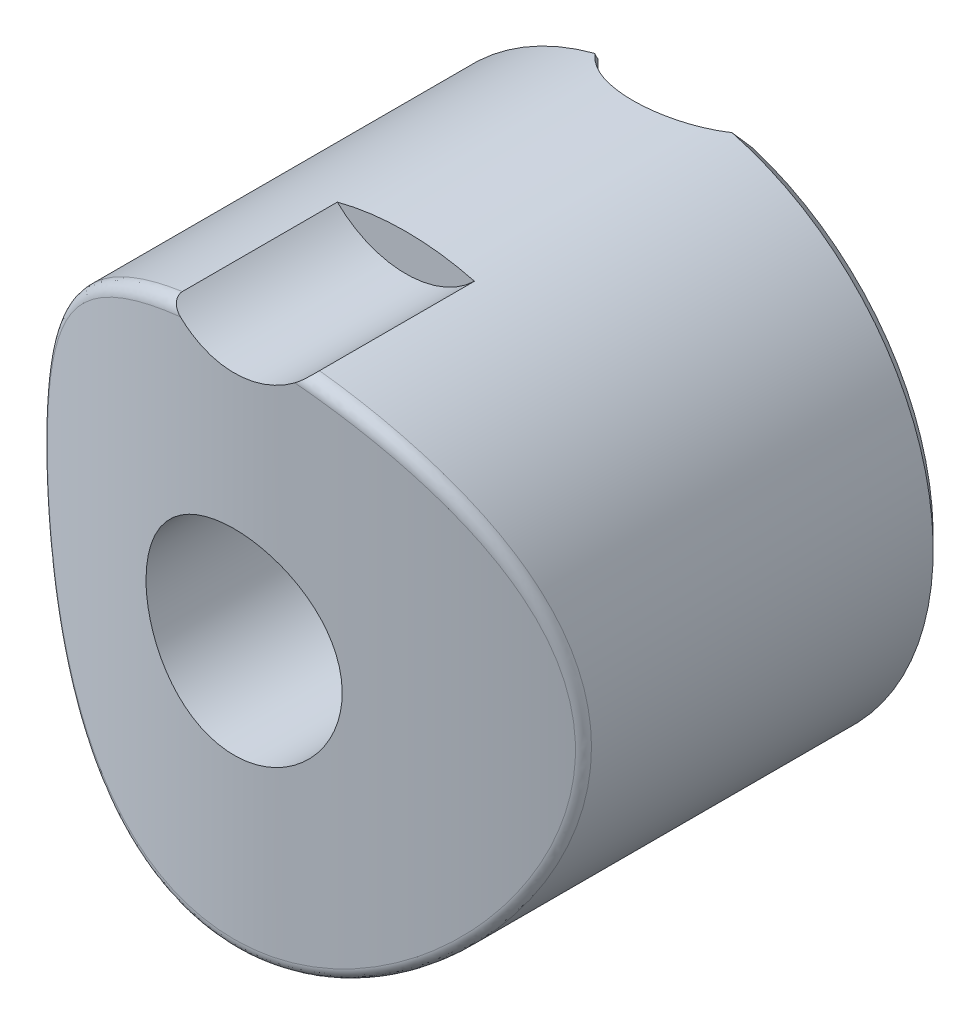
ISO-10303-21;
HEADER;
FILE_DESCRIPTION(('STEP AP214'),'2;1');
FILE_NAME('part.step','',(''),(''),'','','');
FILE_SCHEMA(('AUTOMOTIVE_DESIGN { 1 0 10303 214 1 1 1 1 }'));
ENDSEC;
DATA;
#1=APPLICATION_CONTEXT('core data for automotive mechanical design processes');
#2=APPLICATION_PROTOCOL_DEFINITION('international standard','automotive_design',2000,#1);
#3=PRODUCT_CONTEXT('',#1,'mechanical');
#4=PRODUCT('Part','Part','',(#3));
#5=PRODUCT_RELATED_PRODUCT_CATEGORY('part','',(#4));
#6=PRODUCT_DEFINITION_FORMATION('','',#4);
#7=PRODUCT_DEFINITION_CONTEXT('part definition',#1,'design');
#8=PRODUCT_DEFINITION('design','',#6,#7);
#9=PRODUCT_DEFINITION_SHAPE('','',#8);
#10=(LENGTH_UNIT() NAMED_UNIT(*) SI_UNIT(.MILLI.,.METRE.));
#11=(NAMED_UNIT(*) PLANE_ANGLE_UNIT() SI_UNIT($,.RADIAN.));
#12=(NAMED_UNIT(*) SI_UNIT($,.STERADIAN.) SOLID_ANGLE_UNIT());
#13=UNCERTAINTY_MEASURE_WITH_UNIT(LENGTH_MEASURE(1.E-05),#10,'distance_accuracy_value','');
#14=(GEOMETRIC_REPRESENTATION_CONTEXT(3) GLOBAL_UNCERTAINTY_ASSIGNED_CONTEXT((#13)) GLOBAL_UNIT_ASSIGNED_CONTEXT((#10,
#11,#12)) REPRESENTATION_CONTEXT('',''));
#15=CARTESIAN_POINT('',(0.,0.,0.));
#16=DIRECTION('',(0.,0.,1.));
#17=DIRECTION('',(1.,0.,0.));
#18=AXIS2_PLACEMENT_3D('',#15,#16,#17);
#19=CARTESIAN_POINT('',(0.,6.12361162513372,0.));
#20=DIRECTION('',(0.,-1.,0.));
#21=DIRECTION('',(1.,0.,0.));
#22=AXIS2_PLACEMENT_3D('',#19,#20,#21);
#23=TOROIDAL_SURFACE('',#22,5.5,0.5);
#24=CARTESIAN_POINT('',(0.,6.55662432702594,0.));
#25=DIRECTION('',(0.,-1.,0.));
#26=DIRECTION('',(1.,0.,0.));
#27=AXIS2_PLACEMENT_3D('',#24,#25,#26);
#28=CIRCLE('',#27,5.75);
#29=CARTESIAN_POINT('',(5.39096466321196,6.55662432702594,2.));
#30=VERTEX_POINT('',#29);
#31=CARTESIAN_POINT('',(-5.39096466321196,6.55662432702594,2.));
#32=VERTEX_POINT('',#31);
#33=EDGE_CURVE('E281',#30,#32,#28,.T.);
#34=ORIENTED_EDGE('',*,*,#33,.F.);
#35=CARTESIAN_POINT('',(5.65685424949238,6.12361162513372,2.));
#36=CARTESIAN_POINT('',(5.65688407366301,6.15054765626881,2.));
#37=CARTESIAN_POINT('',(5.65454760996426,6.17746797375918,2.));
#38=CARTESIAN_POINT('',(5.6453707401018,6.2304792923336,2.));
#39=CARTESIAN_POINT('',(5.63853892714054,6.25657177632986,2.));
#40=CARTESIAN_POINT('',(5.62059892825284,6.30723645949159,2.));
#41=CARTESIAN_POINT('',(5.60949098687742,6.33180874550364,2.));
#42=CARTESIAN_POINT('',(5.58340092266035,6.37879149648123,2.));
#43=CARTESIAN_POINT('',(5.56841916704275,6.40120216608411,2.));
#44=CARTESIAN_POINT('',(5.5346930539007,6.44380606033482,2.));
#45=CARTESIAN_POINT('',(5.51587204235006,6.46393848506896,2.));
#46=CARTESIAN_POINT('',(5.47525760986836,6.5009735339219,2.));
#47=CARTESIAN_POINT('',(5.45346117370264,6.51787283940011,2.));
#48=CARTESIAN_POINT('',(5.40626060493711,6.54893030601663,2.));
#49=CARTESIAN_POINT('',(5.38072400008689,6.56288664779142,2.));
#50=CARTESIAN_POINT('',(5.32781002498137,6.58658528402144,2.));
#51=CARTESIAN_POINT('',(5.30043556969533,6.59633407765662,2.));
#52=CARTESIAN_POINT('',(5.27248536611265,6.60388211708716,2.));
#53=B_SPLINE_CURVE_WITH_KNOTS('',3,(#35,#36,#37,#38,#39,#40,#41,#42,#43,#44,#45,#46,#47,#48,#49,
#50,#51,#52),.UNSPECIFIED.,.F.,.F.,(4,2,2,2,2,2,2,2,4),(0.,0.0806828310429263,0.161211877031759,
0.241736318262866,0.322253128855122,0.404570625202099,0.486972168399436,0.57390465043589,
0.660702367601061),.UNSPECIFIED.);
#54=CARTESIAN_POINT('',(5.65685424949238,6.12361162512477,2.));
#55=VERTEX_POINT('',#54);
#56=EDGE_CURVE('E23',#30,#55,#53,.F.);
#57=ORIENTED_EDGE('',*,*,#56,.T.);
#58=CARTESIAN_POINT('',(0.,6.12361162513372,0.));
#59=DIRECTION('',(0.,-1.,0.));
#60=DIRECTION('',(1.,0.,0.));
#61=AXIS2_PLACEMENT_3D('',#58,#59,#60);
#62=CIRCLE('',#61,6.);
#63=CARTESIAN_POINT('',(-5.65685424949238,6.12361162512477,2.));
#64=VERTEX_POINT('',#63);
#65=EDGE_CURVE('E282',#64,#55,#62,.F.);
#66=ORIENTED_EDGE('',*,*,#65,.F.);
#67=CARTESIAN_POINT('',(-5.39096466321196,6.55662432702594,2.));
#68=CARTESIAN_POINT('',(-5.41647014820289,6.54284572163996,2.));
#69=CARTESIAN_POINT('',(-5.44086154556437,6.52696502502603,2.));
#70=CARTESIAN_POINT('',(-5.48675040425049,6.4913727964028,2.));
#71=CARTESIAN_POINT('',(-5.50824135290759,6.47165287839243,2.));
#72=CARTESIAN_POINT('',(-5.54758209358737,6.42877909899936,2.));
#73=CARTESIAN_POINT('',(-5.56542484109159,6.40561874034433,2.));
#74=CARTESIAN_POINT('',(-5.5967345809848,6.35654526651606,2.));
#75=CARTESIAN_POINT('',(-5.61020777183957,6.33063612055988,2.));
#76=CARTESIAN_POINT('',(-5.63179057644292,6.27797871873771,2.));
#77=CARTESIAN_POINT('',(-5.64010696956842,6.25131522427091,2.));
#78=CARTESIAN_POINT('',(-5.65194858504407,6.1969258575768,2.));
#79=CARTESIAN_POINT('',(-5.65547169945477,6.16919952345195,2.));
#80=CARTESIAN_POINT('',(-5.65752509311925,6.11466943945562,2.));
#81=CARTESIAN_POINT('',(-5.65624780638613,6.08787270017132,2.));
#82=CARTESIAN_POINT('',(-5.64920917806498,6.03485931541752,2.));
#83=CARTESIAN_POINT('',(-5.6434452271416,6.00864301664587,2.));
#84=CARTESIAN_POINT('',(-5.63547995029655,5.9831064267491,2.));
#85=B_SPLINE_CURVE_WITH_KNOTS('',3,(#67,#68,#69,#70,#71,#72,#73,#74,#75,#76,#77,#78,#79,#80,#81,
#82,#83,#84),.UNSPECIFIED.,.F.,.F.,(4,2,2,2,2,2,2,2,4),(0.,0.08690409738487,0.174000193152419,
0.261262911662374,0.34840129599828,0.431770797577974,0.515176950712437,0.595275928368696,
0.675421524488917),.UNSPECIFIED.);
#86=EDGE_CURVE('E9',#64,#32,#85,.F.);
#87=ORIENTED_EDGE('',*,*,#86,.T.);
#88=EDGE_LOOP('',(#34,#57,#66,#87));
#89=FACE_BOUND('',#88,.T.);
#90=ADVANCED_FACE('F14',(#89),#23,.F.);
#91=CARTESIAN_POINT('',(0.,0.,0.));
#92=DIRECTION('',(0.,-1.,0.));
#93=DIRECTION('',(1.,0.,0.));
#94=AXIS2_PLACEMENT_3D('',#91,#92,#93);
#95=CYLINDRICAL_SURFACE('',#94,6.);
#96=DIRECTION('',(0.,-1.,0.));
#97=VECTOR('',#96,1.);
#98=CARTESIAN_POINT('',(-5.65685424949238,0.,2.));
#99=LINE('',#98,#97);
#100=CARTESIAN_POINT('',(-5.65685424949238,-8.84590300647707,2.));
#101=VERTEX_POINT('',#100);
#102=EDGE_CURVE('E87',#64,#101,#99,.T.);
#103=ORIENTED_EDGE('',*,*,#102,.F.);
#104=ORIENTED_EDGE('',*,*,#65,.T.);
#105=DIRECTION('',(0.,-1.,0.));
#106=VECTOR('',#105,1.);
#107=CARTESIAN_POINT('',(5.65685424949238,0.,2.));
#108=LINE('',#107,#106);
#109=CARTESIAN_POINT('',(5.65685424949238,-8.84590300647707,2.));
#110=VERTEX_POINT('',#109);
#111=EDGE_CURVE('E96',#110,#55,#108,.F.);
#112=ORIENTED_EDGE('',*,*,#111,.F.);
#113=CARTESIAN_POINT('',(5.67435282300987,-8.77496667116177,1.9498));
#114=CARTESIAN_POINT('',(5.65702664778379,-8.84621603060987,2.00022184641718));
#115=CARTESIAN_POINT('',(5.63897843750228,-8.91734928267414,2.05056053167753));
#116=CARTESIAN_POINT('',(5.60142029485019,-9.05933693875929,2.15103872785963));
#117=CARTESIAN_POINT('',(5.58191079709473,-9.13019141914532,2.20117829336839));
#118=CARTESIAN_POINT('',(5.54140216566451,-9.27161722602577,2.30125535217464));
#119=CARTESIAN_POINT('',(5.52040303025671,-9.34218855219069,2.35119284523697));
#120=CARTESIAN_POINT('',(5.47688221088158,-9.48304058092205,2.45086060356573));
#121=CARTESIAN_POINT('',(5.45436007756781,-9.55332119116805,2.50059080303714));
#122=CARTESIAN_POINT('',(5.43106618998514,-9.62343182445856,2.55020000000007));
#123=B_SPLINE_CURVE_WITH_KNOTS('',3,(#113,#114,#115,#116,#117,#118,#119,#120,#121,#122),
.UNSPECIFIED.,.F.,.F.,(4,2,2,2,4),(0.,0.266964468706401,0.533849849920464,0.800735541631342,
1.06770032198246),.UNSPECIFIED.);
#124=CARTESIAN_POINT('',(5.45435605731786,-9.5524865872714,2.5));
#125=VERTEX_POINT('',#124);
#126=EDGE_CURVE('E108',#110,#125,#123,.T.);
#127=ORIENTED_EDGE('',*,*,#126,.T.);
#128=CARTESIAN_POINT('',(-5.45435605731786,-9.5524865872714,2.5));
#129=CARTESIAN_POINT('',(-5.38129194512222,-9.59419617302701,2.65935324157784));
#130=CARTESIAN_POINT('',(-5.30162045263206,-9.63858371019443,2.81478312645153));
#131=CARTESIAN_POINT('',(-5.1296552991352,-9.73119910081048,3.1172052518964));
#132=CARTESIAN_POINT('',(-5.03736716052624,-9.77942527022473,3.26420114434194));
#133=CARTESIAN_POINT('',(-4.74224213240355,-9.92770925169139,3.69202864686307));
#134=CARTESIAN_POINT('',(-4.52123446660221,-10.0313183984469,3.9595058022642));
#135=CARTESIAN_POINT('',(-4.15789831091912,-10.1847571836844,4.32918189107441));
#136=CARTESIAN_POINT('',(-4.03147997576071,-10.2355750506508,4.4471522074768));
#137=CARTESIAN_POINT('',(-3.76843834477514,-10.3353090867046,4.67212814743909));
#138=CARTESIAN_POINT('',(-3.63181487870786,-10.384225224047,4.77913358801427));
#139=CARTESIAN_POINT('',(-3.34910026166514,-10.4788240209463,4.98133893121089));
#140=CARTESIAN_POINT('',(-3.20301121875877,-10.5245073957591,5.07654144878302));
#141=CARTESIAN_POINT('',(-2.90216155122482,-10.6114067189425,5.25432809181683));
#142=CARTESIAN_POINT('',(-2.74740502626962,-10.6526247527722,5.33691811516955));
#143=CARTESIAN_POINT('',(-2.43248689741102,-10.7288795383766,5.48753229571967));
#144=CARTESIAN_POINT('',(-2.27244164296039,-10.7639999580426,5.55575690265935));
#145=CARTESIAN_POINT('',(-1.9459631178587,-10.8277823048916,5.67834570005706));
#146=CARTESIAN_POINT('',(-1.77953316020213,-10.8564475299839,5.73271696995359));
#147=CARTESIAN_POINT('',(-1.44161525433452,-10.9064613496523,5.8268765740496));
#148=CARTESIAN_POINT('',(-1.27013014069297,-10.9278139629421,5.86667291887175));
#149=CARTESIAN_POINT('',(-0.923547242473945,-10.9625441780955,5.93111414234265));
#150=CARTESIAN_POINT('',(-0.748449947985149,-10.9759228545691,5.95576106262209));
#151=CARTESIAN_POINT('',(-0.417019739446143,-10.9931942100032,5.98752612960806));
#152=CARTESIAN_POINT('',(-0.260897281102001,-10.9980161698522,5.99636248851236));
#153=CARTESIAN_POINT('',(0.0516210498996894,-11.0009884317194,6.00181251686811));
#154=CARTESIAN_POINT('',(0.208016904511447,-10.9991391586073,5.99842696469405));
#155=CARTESIAN_POINT('',(0.519815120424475,-10.9888180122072,5.97948022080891));
#156=CARTESIAN_POINT('',(0.675217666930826,-10.980347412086,5.96392136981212));
#157=CARTESIAN_POINT('',(0.983862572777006,-10.9570054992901,5.92083579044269));
#158=CARTESIAN_POINT('',(1.13710493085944,-10.94213418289,5.8933090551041));
#159=CARTESIAN_POINT('',(1.43315538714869,-10.9072093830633,5.82820176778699));
#160=CARTESIAN_POINT('',(1.57611452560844,-10.8874337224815,5.79115726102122));
#161=CARTESIAN_POINT('',(1.85821589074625,-10.8428533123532,5.70690234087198));
#162=CARTESIAN_POINT('',(1.9973568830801,-10.8180469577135,5.65968868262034));
#163=CARTESIAN_POINT('',(2.40781435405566,-10.7368521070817,5.50345337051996));
#164=CARTESIAN_POINT('',(2.67237295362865,-10.6736622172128,5.37979105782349));
#165=CARTESIAN_POINT('',(3.19683392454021,-10.5289982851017,5.08696070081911));
#166=CARTESIAN_POINT('',(3.45493617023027,-10.4465158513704,4.91509816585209));
#167=CARTESIAN_POINT('',(3.94014596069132,-10.2733480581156,4.53544469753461));
#168=CARTESIAN_POINT('',(4.16723666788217,-10.1826582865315,4.32763438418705));
#169=CARTESIAN_POINT('',(4.59730514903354,-9.99611590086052,3.86889067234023));
#170=CARTESIAN_POINT('',(4.79856437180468,-9.90022739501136,3.61634724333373));
#171=CARTESIAN_POINT('',(5.06887853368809,-9.76302925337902,3.21443282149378));
#172=CARTESIAN_POINT('',(5.15373156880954,-9.7183958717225,3.07658818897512));
#173=CARTESIAN_POINT('',(5.31243302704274,-9.63255755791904,2.79362463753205));
#174=CARTESIAN_POINT('',(5.3862775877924,-9.59135383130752,2.6485031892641));
#175=CARTESIAN_POINT('',(5.45435605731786,-9.5524865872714,2.5));
#176=B_SPLINE_CURVE_WITH_KNOTS('',3,(#128,#129,#130,#131,#132,#133,#134,#135,#136,#137,#138,
#139,#140,#141,#142,#143,#144,#145,#146,#147,#148,#149,#150,#151,#152,#153,#154,#155,#156,#157,
#158,#159,#160,#161,#162,#163,#164,#165,#166,#167,#168,#169,#170,#171,#172,#173,#174,#175),
.UNSPECIFIED.,.F.,.F.,(4,2,2,2,2,2,2,2,2,2,2,2,2,2,2,2,2,2,2,2,2,2,2,4),(0.,0.54010219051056,
1.07996872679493,2.16035596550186,2.70056608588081,3.24078521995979,3.78088445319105,
4.32073034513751,4.85245422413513,5.38390583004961,5.91506490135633,6.44615237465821,
6.91488851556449,7.38359480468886,7.85221099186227,8.32082745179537,8.76731855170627,
9.21395233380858,10.1065843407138,11.0654103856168,12.0247549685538,13.0309370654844,
13.5341849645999,14.037609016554),.UNSPECIFIED.);
#177=CARTESIAN_POINT('',(-5.45435605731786,-9.5524865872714,2.5));
#178=VERTEX_POINT('',#177);
#179=EDGE_CURVE('E103',#178,#125,#176,.T.);
#180=ORIENTED_EDGE('',*,*,#179,.F.);
#181=CARTESIAN_POINT('',(-5.43106618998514,-9.62343182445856,2.55020000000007));
#182=CARTESIAN_POINT('',(-5.45436007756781,-9.55332119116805,2.50059080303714));
#183=CARTESIAN_POINT('',(-5.47688221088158,-9.48304058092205,2.45086060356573));
#184=CARTESIAN_POINT('',(-5.52040303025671,-9.34218855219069,2.35119284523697));
#185=CARTESIAN_POINT('',(-5.54140216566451,-9.27161722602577,2.30125535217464));
#186=CARTESIAN_POINT('',(-5.58191079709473,-9.13019141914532,2.20117829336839));
#187=CARTESIAN_POINT('',(-5.60142029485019,-9.05933693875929,2.15103872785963));
#188=CARTESIAN_POINT('',(-5.63897843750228,-8.91734928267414,2.05056053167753));
#189=CARTESIAN_POINT('',(-5.65702664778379,-8.84621603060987,2.00022184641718));
#190=CARTESIAN_POINT('',(-5.67435282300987,-8.77496667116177,1.9498));
#191=B_SPLINE_CURVE_WITH_KNOTS('',3,(#181,#182,#183,#184,#185,#186,#187,#188,#189,#190),
.UNSPECIFIED.,.F.,.F.,(4,2,2,2,4),(0.,0.266964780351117,0.533850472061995,0.800735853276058,
1.06770032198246),.UNSPECIFIED.);
#192=EDGE_CURVE('E99',#178,#101,#191,.T.);
#193=ORIENTED_EDGE('',*,*,#192,.T.);
#194=EDGE_LOOP('',(#103,#104,#112,#127,#180,#193));
#195=FACE_BOUND('',#194,.T.);
#196=CARTESIAN_POINT('',(-5.5,0.,2.39791576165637));
#197=CARTESIAN_POINT('',(-5.49999985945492,0.078021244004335,2.39791616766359));
#198=CARTESIAN_POINT('',(-5.49833310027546,0.156044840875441,2.40175041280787));
#199=CARTESIAN_POINT('',(-5.49173804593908,0.31121975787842,2.41679046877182));
#200=CARTESIAN_POINT('',(-5.48680928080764,0.388370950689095,2.42799734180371));
#201=CARTESIAN_POINT('',(-5.46732095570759,0.618072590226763,2.47172719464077));
#202=CARTESIAN_POINT('',(-5.44806107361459,0.768347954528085,2.51435169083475));
#203=CARTESIAN_POINT('',(-5.40494303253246,1.02428827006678,2.60546441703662));
#204=CARTESIAN_POINT('',(-5.38335718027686,1.13188382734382,2.64997721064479));
#205=CARTESIAN_POINT('',(-5.33474440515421,1.34244403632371,2.74653077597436));
#206=CARTESIAN_POINT('',(-5.30771362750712,1.44540534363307,2.79857687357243));
#207=CARTESIAN_POINT('',(-5.24857418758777,1.64729375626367,2.9079796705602));
#208=CARTESIAN_POINT('',(-5.21645143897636,1.74620868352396,2.96535091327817));
#209=CARTESIAN_POINT('',(-5.14743841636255,1.94022415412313,3.08359834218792));
#210=CARTESIAN_POINT('',(-5.11054655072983,2.03532341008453,3.14447569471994));
#211=CARTESIAN_POINT('',(-5.00029381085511,2.29800475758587,3.31883651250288));
#212=CARTESIAN_POINT('',(-4.92165638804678,2.46169834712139,3.43487363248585));
#213=CARTESIAN_POINT('',(-4.74948461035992,2.77939235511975,3.66928232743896));
#214=CARTESIAN_POINT('',(-4.6559399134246,2.93338593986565,3.78765547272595));
#215=CARTESIAN_POINT('',(-4.45392497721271,3.23186845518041,4.02325751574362));
#216=CARTESIAN_POINT('',(-4.34547196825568,3.37636807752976,4.14048756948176));
#217=CARTESIAN_POINT('',(-4.11333114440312,3.65560532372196,4.37118969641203));
#218=CARTESIAN_POINT('',(-3.9896515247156,3.79034813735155,4.48466374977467));
#219=CARTESIAN_POINT('',(-3.66132769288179,4.11350564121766,4.76032116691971));
#220=CARTESIAN_POINT('',(-3.44693538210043,4.29542496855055,4.91877367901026));
#221=CARTESIAN_POINT('',(-2.98285644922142,4.62969562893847,5.21324376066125));
#222=CARTESIAN_POINT('',(-2.73323304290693,4.78209878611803,5.34930058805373));
#223=CARTESIAN_POINT('',(-2.25406244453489,5.02252068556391,5.56538751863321));
#224=CARTESIAN_POINT('',(-2.0305984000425,5.11732472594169,5.65118269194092));
#225=CARTESIAN_POINT('',(-1.68204594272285,5.23792850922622,5.76069593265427));
#226=CARTESIAN_POINT('',(-1.56360044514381,5.2745366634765,5.79401044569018));
#227=CARTESIAN_POINT('',(-1.32289010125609,5.3399898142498,5.85365766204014));
#228=CARTESIAN_POINT('',(-1.20062694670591,5.36883819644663,5.87999341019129));
#229=CARTESIAN_POINT('',(-0.9522187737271,5.41843467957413,5.92531285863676));
#230=CARTESIAN_POINT('',(-0.826052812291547,5.43912559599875,5.94424464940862));
#231=CARTESIAN_POINT('',(-0.571642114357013,5.47171529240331,5.97407943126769));
#232=CARTESIAN_POINT('',(-0.443397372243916,5.48361404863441,5.98498240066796));
#233=CARTESIAN_POINT('',(-0.185994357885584,5.49836510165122,5.99850065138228));
#234=CARTESIAN_POINT('',(-0.0568364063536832,5.50122043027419,6.00111871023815));
#235=CARTESIAN_POINT('',(0.201251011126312,5.49783154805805,5.99801227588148));
#236=CARTESIAN_POINT('',(0.330180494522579,5.49158806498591,5.99228844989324));
#237=CARTESIAN_POINT('',(0.573036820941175,5.47127583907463,5.973679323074));
#238=CARTESIAN_POINT('',(0.687103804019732,5.45810782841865,5.96161846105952));
#239=CARTESIAN_POINT('',(0.913379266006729,5.42483542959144,5.93117153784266));
#240=CARTESIAN_POINT('',(1.02558712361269,5.40472876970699,5.91278340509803));
#241=CARTESIAN_POINT('',(1.35828237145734,5.3344455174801,5.84858397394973));
#242=CARTESIAN_POINT('',(1.57503769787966,5.27428854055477,5.79372186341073));
#243=CARTESIAN_POINT('',(2.00326929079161,5.12743397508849,5.6603529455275));
#244=CARTESIAN_POINT('',(2.21406648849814,5.03966167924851,5.58089127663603));
#245=CARTESIAN_POINT('',(2.61707586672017,4.842648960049,5.40364619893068));
#246=CARTESIAN_POINT('',(2.80928012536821,4.7333994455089,5.30585503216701));
#247=CARTESIAN_POINT('',(3.13070963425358,4.52506346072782,5.12098373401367));
#248=CARTESIAN_POINT('',(3.26408561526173,4.42967416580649,5.03683170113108));
#249=CARTESIAN_POINT('',(3.5192390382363,4.22980079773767,4.8619816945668));
#250=CARTESIAN_POINT('',(3.6410151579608,4.12531569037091,4.77128297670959));
#251=CARTESIAN_POINT('',(3.87338508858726,3.9079768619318,4.58466642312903));
#252=CARTESIAN_POINT('',(3.98394354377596,3.79509851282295,4.48873346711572));
#253=CARTESIAN_POINT('',(4.19364530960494,3.5620096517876,4.29346674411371));
#254=CARTESIAN_POINT('',(4.29279078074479,3.44180053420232,4.19413362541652));
#255=CARTESIAN_POINT('',(4.48222976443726,3.19137589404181,3.99115962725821));
#256=CARTESIAN_POINT('',(4.57224379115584,3.0609864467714,3.88747296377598));
#257=CARTESIAN_POINT('',(4.74077182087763,2.79287896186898,3.68007222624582));
#258=CARTESIAN_POINT('',(4.81928065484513,2.65515766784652,3.57635816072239));
#259=CARTESIAN_POINT('',(4.96459773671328,2.37233909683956,3.37171522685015));
#260=CARTESIAN_POINT('',(5.03143657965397,2.22726243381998,3.27077967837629));
#261=CARTESIAN_POINT('',(5.15337424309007,1.92841181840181,3.07505585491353));
#262=CARTESIAN_POINT('',(5.20848533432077,1.77464717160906,2.98026122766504));
#263=CARTESIAN_POINT('',(5.29903192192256,1.47999330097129,2.81562539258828));
#264=CARTESIAN_POINT('',(5.33617058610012,1.34055056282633,2.74416595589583));
#265=CARTESIAN_POINT('',(5.40028415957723,1.05288623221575,2.61573511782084));
#266=CARTESIAN_POINT('',(5.42727609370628,0.90467983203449,2.55873950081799));
#267=CARTESIAN_POINT('',(5.46574661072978,0.625935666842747,2.47535562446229));
#268=CARTESIAN_POINT('',(5.47910077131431,0.4967747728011,2.44537880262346));
#269=CARTESIAN_POINT('',(5.49654285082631,0.234831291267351,2.40593513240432));
#270=CARTESIAN_POINT('',(5.50065059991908,0.102057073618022,2.39642439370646));
#271=CARTESIAN_POINT('',(5.49917847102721,-0.163380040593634,2.3997991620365));
#272=CARTESIAN_POINT('',(5.49358022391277,-0.29604224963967,2.41272713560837));
#273=CARTESIAN_POINT('',(5.47327095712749,-0.557289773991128,2.45843031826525));
#274=CARTESIAN_POINT('',(5.45853931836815,-0.685865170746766,2.4912504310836));
#275=CARTESIAN_POINT('',(5.42476231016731,-0.912366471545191,2.56382875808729));
#276=CARTESIAN_POINT('',(5.40711800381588,-1.01138049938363,2.60098661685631));
#277=CARTESIAN_POINT('',(5.3671769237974,-1.20550218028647,2.68243735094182));
#278=CARTESIAN_POINT('',(5.34487670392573,-1.30060687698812,2.72673550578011));
#279=CARTESIAN_POINT('',(5.29593749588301,-1.48741631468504,2.82061279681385));
#280=CARTESIAN_POINT('',(5.26928345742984,-1.57910785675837,2.87021003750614));
#281=CARTESIAN_POINT('',(5.21194473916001,-1.75913351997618,2.97306434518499));
#282=CARTESIAN_POINT('',(5.18125853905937,-1.84746635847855,3.02632278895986));
#283=CARTESIAN_POINT('',(5.08555061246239,-2.10224208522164,3.18625202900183));
#284=CARTESIAN_POINT('',(5.01523274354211,-2.26456715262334,3.29634172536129));
#285=CARTESIAN_POINT('',(4.86063307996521,-2.57973611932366,3.52034914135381));
#286=CARTESIAN_POINT('',(4.77634005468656,-2.73257225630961,3.63426988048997));
#287=CARTESIAN_POINT('',(4.59383283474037,-3.02935971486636,3.86238670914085));
#288=CARTESIAN_POINT('',(4.49562471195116,-3.17331487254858,3.97658265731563));
#289=CARTESIAN_POINT('',(4.28507118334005,-3.45234581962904,4.20262143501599));
#290=CARTESIAN_POINT('',(4.17273270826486,-3.58742591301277,4.31446538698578));
#291=CARTESIAN_POINT('',(3.95583345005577,-3.82388352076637,4.51318020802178));
#292=CARTESIAN_POINT('',(3.85371964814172,-3.92685299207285,4.60082320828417));
#293=CARTESIAN_POINT('',(3.63975733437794,-4.12596035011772,4.77189265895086));
#294=CARTESIAN_POINT('',(3.52790644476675,-4.22209655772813,4.85531807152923));
#295=CARTESIAN_POINT('',(3.17798519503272,-4.49873460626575,5.09711110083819));
#296=CARTESIAN_POINT('',(2.9249967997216,-4.66807497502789,5.24751425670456));
#297=CARTESIAN_POINT('',(2.44209425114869,-4.9339690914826,5.48556525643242));
#298=CARTESIAN_POINT('',(2.21973057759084,-5.03832934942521,5.57972236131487));
#299=CARTESIAN_POINT('',(1.87130867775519,-5.17337078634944,5.7020527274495));
#300=CARTESIAN_POINT('',(1.75265111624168,-5.21481057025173,5.73968701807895));
#301=CARTESIAN_POINT('',(1.51097014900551,-5.28989200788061,5.80798704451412));
#302=CARTESIAN_POINT('',(1.38794871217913,-5.32353712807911,5.8386558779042));
#303=CARTESIAN_POINT('',(1.13730197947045,-5.38268115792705,5.89263177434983));
#304=CARTESIAN_POINT('',(1.00964803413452,-5.40811375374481,5.91587889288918));
#305=CARTESIAN_POINT('',(0.751645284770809,-5.4499636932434,5.95416094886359));
#306=CARTESIAN_POINT('',(0.621296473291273,-5.466381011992,5.96919586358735));
#307=CARTESIAN_POINT('',(0.359117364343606,-5.48984045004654,5.9906866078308));
#308=CARTESIAN_POINT('',(0.227287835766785,-5.49688722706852,5.99714669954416));
#309=CARTESIAN_POINT('',(-0.036668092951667,-5.50146101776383,6.00133920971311));
#310=CARTESIAN_POINT('',(-0.168794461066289,-5.49898901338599,5.99907252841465));
#311=CARTESIAN_POINT('',(-0.416310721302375,-5.48544993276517,5.98666477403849));
#312=CARTESIAN_POINT('',(-0.531810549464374,-5.47544729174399,5.97749891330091));
#313=CARTESIAN_POINT('',(-0.761289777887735,-5.44828336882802,5.9526264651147));
#314=CARTESIAN_POINT('',(-0.875268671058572,-5.43111975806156,5.93691774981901));
#315=CARTESIAN_POINT('',(-1.10088425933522,-5.38991621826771,5.89924799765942));
#316=CARTESIAN_POINT('',(-1.21252169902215,-5.36587851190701,5.87728898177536));
#317=CARTESIAN_POINT('',(-1.43286997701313,-5.31128885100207,5.8274922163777));
#318=CARTESIAN_POINT('',(-1.54157968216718,-5.28073441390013,5.79965222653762));
#319=CARTESIAN_POINT('',(-1.86757258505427,-5.17829846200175,5.70648282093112));
#320=CARTESIAN_POINT('',(-2.0794014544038,-5.09663435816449,5.63241382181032));
#321=CARTESIAN_POINT('',(-2.48524675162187,-4.91156162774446,5.46551332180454));
#322=CARTESIAN_POINT('',(-2.679254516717,-4.80814250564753,5.37267276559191));
#323=CARTESIAN_POINT('',(-3.00258375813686,-4.61096282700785,5.19706627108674));
#324=CARTESIAN_POINT('',(-3.13606211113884,-4.5211053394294,5.11745807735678));
#325=CARTESIAN_POINT('',(-3.39201536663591,-4.33238010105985,4.951514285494));
#326=CARTESIAN_POINT('',(-3.51448913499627,-4.23351142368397,4.86517799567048));
#327=CARTESIAN_POINT('',(-3.74873005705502,-4.02758094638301,4.6870807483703));
#328=CARTESIAN_POINT('',(-3.8604702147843,-3.92049964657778,4.59530700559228));
#329=CARTESIAN_POINT('',(-4.07305740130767,-3.69915517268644,4.40797792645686));
#330=CARTESIAN_POINT('',(-4.17390607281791,-3.58489308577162,4.31242316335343));
#331=CARTESIAN_POINT('',(-4.36720546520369,-3.34687630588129,4.11665886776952));
#332=CARTESIAN_POINT('',(-4.45940010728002,-3.22296069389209,4.0163926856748));
#333=CARTESIAN_POINT('',(-4.63283728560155,-2.96826044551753,3.81503242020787));
#334=CARTESIAN_POINT('',(-4.71407671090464,-2.83747387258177,3.71393811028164));
#335=CARTESIAN_POINT('',(-4.86556588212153,-2.56904513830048,3.513125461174));
#336=CARTESIAN_POINT('',(-4.93583237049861,-2.43141385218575,3.41340524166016));
#337=CARTESIAN_POINT('',(-5.06540591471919,-2.14845871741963,3.21797717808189));
#338=CARTESIAN_POINT('',(-5.12472002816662,-2.00313990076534,3.12226678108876));
#339=CARTESIAN_POINT('',(-5.23230121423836,-1.7025465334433,2.93843540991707));
#340=CARTESIAN_POINT('',(-5.28050622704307,-1.54722197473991,2.85035870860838));
#341=CARTESIAN_POINT('',(-5.36429610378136,-1.22553537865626,2.68933292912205));
#342=CARTESIAN_POINT('',(-5.39989426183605,-1.05918518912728,2.616367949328));
#343=CARTESIAN_POINT('',(-5.45118779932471,-0.744992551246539,2.50750875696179));
#344=CARTESIAN_POINT('',(-5.46929894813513,-0.599131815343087,2.46732628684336));
#345=CARTESIAN_POINT('',(-5.4876147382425,-0.376356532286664,2.42616899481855));
#346=CARTESIAN_POINT('',(-5.49224452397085,-0.301542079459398,2.41563741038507));
#347=CARTESIAN_POINT('',(-5.49843643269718,-0.151152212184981,2.40151238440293));
#348=CARTESIAN_POINT('',(-5.50000013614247,-0.0755772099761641,2.39791536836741));
#349=CARTESIAN_POINT('',(-5.5,0.,2.39791576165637));
#350=B_SPLINE_CURVE_WITH_KNOTS('',3,(#196,#197,#198,#199,#200,#201,#202,#203,#204,#205,#206,
#207,#208,#209,#210,#211,#212,#213,#214,#215,#216,#217,#218,#219,#220,#221,#222,#223,#224,#225,
#226,#227,#228,#229,#230,#231,#232,#233,#234,#235,#236,#237,#238,#239,#240,#241,#242,#243,#244,
#245,#246,#247,#248,#249,#250,#251,#252,#253,#254,#255,#256,#257,#258,#259,#260,#261,#262,#263,
#264,#265,#266,#267,#268,#269,#270,#271,#272,#273,#274,#275,#276,#277,#278,#279,#280,#281,#282,
#283,#284,#285,#286,#287,#288,#289,#290,#291,#292,#293,#294,#295,#296,#297,#298,#299,#300,#301,
#302,#303,#304,#305,#306,#307,#308,#309,#310,#311,#312,#313,#314,#315,#316,#317,#318,#319,#320,
#321,#322,#323,#324,#325,#326,#327,#328,#329,#330,#331,#332,#333,#334,#335,#336,#337,#338,#339,
#340,#341,#342,#343,#344,#345,#346,#347,#348,#349),.UNSPECIFIED.,.T.,.F.,(4,2,2,2,2,2,2,2,2,2,2,
2,2,2,2,2,2,2,2,2,2,2,2,2,2,2,2,2,2,2,2,2,2,2,2,2,2,2,2,2,2,2,2,2,2,2,2,2,2,2,2,2,2,2,2,2,2,2,2,
2,2,2,2,2,2,2,2,2,2,2,2,2,2,2,2,2,4),(0.,0.233955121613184,0.467943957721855,0.937463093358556,
1.29229646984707,1.6473819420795,2.00346743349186,2.35967207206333,3.0052948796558,
3.65136755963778,4.29669972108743,4.9416860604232,5.90632521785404,6.86925500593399,
7.63823538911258,8.02294257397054,8.40748163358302,8.79467035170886,9.18186011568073,
9.56892005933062,9.95594904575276,10.3019063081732,10.647976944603,11.3395324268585,
12.0622798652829,12.7853338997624,13.3375570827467,13.8898431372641,14.4438190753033,
14.9976899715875,15.5652557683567,16.1330757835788,16.6993840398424,17.2650968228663,
17.7473622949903,18.2288149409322,18.6270067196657,19.0243437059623,19.4224334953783,
19.8214252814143,20.1426249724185,20.464063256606,20.7866371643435,21.1093330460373,
21.7334822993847,22.3581355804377,22.9825171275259,23.6065936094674,24.1144603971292,
24.6224515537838,25.6355518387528,26.4214354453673,26.8146113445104,27.2076120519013,
27.6037110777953,27.999811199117,28.3957143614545,28.7915766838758,29.1400462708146,
29.4886292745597,29.8370996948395,30.1857031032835,30.8991836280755,31.6130091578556,
32.1508779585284,32.6888021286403,33.2280456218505,33.7672076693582,34.3191642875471,
34.8712773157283,35.4225395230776,35.9734452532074,36.5273577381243,37.0806843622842,
37.5354448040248,37.762188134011,37.9888145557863),.UNSPECIFIED.);
#351=CARTESIAN_POINT('',(-5.5,0.,2.39791576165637));
#352=VERTEX_POINT('',#351);
#353=EDGE_CURVE('E182',#352,#352,#350,.T.);
#354=ORIENTED_EDGE('',*,*,#353,.F.);
#355=EDGE_LOOP('',(#354));
#356=FACE_BOUND('',#355,.T.);
#357=ADVANCED_FACE('F100',(#195,#356),#95,.F.);
#358=CARTESIAN_POINT('',(0.,0.,2.));
#359=DIRECTION('',(0.,0.,1.));
#360=DIRECTION('',(1.,0.,0.));
#361=AXIS2_PLACEMENT_3D('',#358,#359,#360);
#362=PLANE('',#361);
#363=ORIENTED_EDGE('',*,*,#56,.F.);
#364=CARTESIAN_POINT('',(29.4634628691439,-7.17349573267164,2.));
#365=CARTESIAN_POINT('',(28.4276178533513,-6.57683504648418,2.));
#366=CARTESIAN_POINT('',(27.3917198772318,-5.98026623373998,2.));
#367=CARTESIAN_POINT('',(25.319730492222,-4.78742555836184,2.));
#368=CARTESIAN_POINT('',(24.2836390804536,-4.19115370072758,2.));
#369=CARTESIAN_POINT('',(22.2107394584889,-2.99876946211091,2.));
#370=CARTESIAN_POINT('',(21.173931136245,-2.40265727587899,2.));
#371=CARTESIAN_POINT('',(19.0999499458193,-1.21110542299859,2.));
#372=CARTESIAN_POINT('',(18.0627770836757,-0.615665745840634,2.));
#373=CARTESIAN_POINT('',(16.0153211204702,0.558371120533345,2.));
#374=CARTESIAN_POINT('',(15.005054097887,1.13699632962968,2.));
#375=CARTESIAN_POINT('',(13.4888409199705,2.00356928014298,2.));
#376=CARTESIAN_POINT('',(12.9832888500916,2.29220641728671,2.));
#377=CARTESIAN_POINT('',(11.9718134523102,2.86882459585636,2.));
#378=CARTESIAN_POINT('',(11.46589012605,3.15680564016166,2.));
#379=CARTESIAN_POINT('',(10.4536515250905,3.73172730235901,2.));
#380=CARTESIAN_POINT('',(9.94733641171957,4.01866820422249,2.));
#381=CARTESIAN_POINT('',(8.93387305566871,4.59109771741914,2.));
#382=CARTESIAN_POINT('',(8.42672479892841,4.87658630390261,2.));
#383=CARTESIAN_POINT('',(7.66499639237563,5.30297317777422,2.));
#384=CARTESIAN_POINT('',(7.41092982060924,5.4447886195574,2.));
#385=CARTESIAN_POINT('',(6.90233669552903,5.72759190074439,2.));
#386=CARTESIAN_POINT('',(6.64781014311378,5.86857974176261,2.));
#387=CARTESIAN_POINT('',(6.13813842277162,6.14941666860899,2.));
#388=CARTESIAN_POINT('',(5.88299327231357,6.28926578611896,2.));
#389=CARTESIAN_POINT('',(5.37182726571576,6.56735296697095,2.));
#390=CARTESIAN_POINT('',(5.11580641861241,6.70559104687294,2.));
#391=CARTESIAN_POINT('',(4.74703731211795,6.90247013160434,2.));
#392=CARTESIAN_POINT('',(4.63481131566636,6.96208923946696,2.));
#393=CARTESIAN_POINT('',(4.41006039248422,7.08076327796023,2.));
#394=CARTESIAN_POINT('',(4.29753546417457,7.13981820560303,2.));
#395=CARTESIAN_POINT('',(4.07210791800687,7.25724725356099,2.));
#396=CARTESIAN_POINT('',(3.95920524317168,7.31562126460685,2.));
#397=CARTESIAN_POINT('',(3.73296054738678,7.43151151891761,2.));
#398=CARTESIAN_POINT('',(3.61961852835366,7.48902776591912,2.));
#399=CARTESIAN_POINT('',(3.3914650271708,7.60344526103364,2.));
#400=CARTESIAN_POINT('',(3.27664910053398,7.66033766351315,2.));
#401=CARTESIAN_POINT('',(3.04633056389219,7.77271410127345,2.));
#402=CARTESIAN_POINT('',(2.93082796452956,7.82819815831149,2.));
#403=CARTESIAN_POINT('',(2.69897789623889,7.93731913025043,2.));
#404=CARTESIAN_POINT('',(2.5826305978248,7.9909564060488,2.));
#405=CARTESIAN_POINT('',(2.34884326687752,8.09578549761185,2.));
#406=CARTESIAN_POINT('',(2.23140330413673,8.14697746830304,2.));
#407=CARTESIAN_POINT('',(1.98438079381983,8.25056568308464,2.));
#408=CARTESIAN_POINT('',(1.85466534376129,8.30264798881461,2.));
#409=CARTESIAN_POINT('',(1.5930723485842,8.40125491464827,2.));
#410=CARTESIAN_POINT('',(1.46119429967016,8.44777821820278,2.));
#411=CARTESIAN_POINT('',(1.196400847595,8.53234575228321,2.));
#412=CARTESIAN_POINT('',(1.0635158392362,8.57048318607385,2.));
#413=CARTESIAN_POINT('',(0.795049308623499,8.63577539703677,2.));
#414=CARTESIAN_POINT('',(0.659469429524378,8.66293666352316,2.));
#415=CARTESIAN_POINT('',(0.412019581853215,8.69906242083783,2.));
#416=CARTESIAN_POINT('',(0.300518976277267,8.71049802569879,2.));
#417=CARTESIAN_POINT('',(0.07695248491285,8.72261749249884,2.));
#418=CARTESIAN_POINT('',(-0.0351131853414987,8.72330518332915,2.));
#419=CARTESIAN_POINT('',(-0.259566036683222,8.71381218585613,2.));
#420=CARTESIAN_POINT('',(-0.371949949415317,8.703555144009,2.));
#421=CARTESIAN_POINT('',(-0.539486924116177,8.68083090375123,2.));
#422=CARTESIAN_POINT('',(-0.595172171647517,8.67203016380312,2.));
#423=CARTESIAN_POINT('',(-0.706142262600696,8.6522066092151,2.));
#424=CARTESIAN_POINT('',(-0.761427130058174,8.6411839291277,2.));
#425=CARTESIAN_POINT('',(-0.996209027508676,8.58996079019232,2.));
#426=CARTESIAN_POINT('',(-1.17364341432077,8.54018522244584,2.));
#427=CARTESIAN_POINT('',(-1.43641620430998,8.45535203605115,2.));
#428=CARTESIAN_POINT('',(-1.52352091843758,8.42534771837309,2.));
#429=CARTESIAN_POINT('',(-1.69675182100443,8.36262681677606,2.));
#430=CARTESIAN_POINT('',(-1.78287810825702,8.32991050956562,2.));
#431=CARTESIAN_POINT('',(-2.04080829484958,8.22826251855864,2.));
#432=CARTESIAN_POINT('',(-2.21133375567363,8.1561121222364,2.));
#433=CARTESIAN_POINT('',(-2.54984116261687,8.00645634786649,2.));
#434=CARTESIAN_POINT('',(-2.71782472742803,7.9289545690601,2.));
#435=CARTESIAN_POINT('',(-3.05637407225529,7.76831702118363,2.));
#436=CARTESIAN_POINT('',(-3.22689522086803,7.6850876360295,2.));
#437=CARTESIAN_POINT('',(-3.56667253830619,7.51603875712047,2.));
#438=CARTESIAN_POINT('',(-3.73592852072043,7.43021889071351,2.));
#439=CARTESIAN_POINT('',(-4.07296107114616,7.2570287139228,2.));
#440=CARTESIAN_POINT('',(-4.24074063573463,7.16966422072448,2.));
#441=CARTESIAN_POINT('',(-4.57558933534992,6.99360825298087,2.));
#442=CARTESIAN_POINT('',(-4.74265850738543,6.9049168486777,2.));
#443=CARTESIAN_POINT('',(-5.25065589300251,6.63331164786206,2.));
#444=CARTESIAN_POINT('',(-5.5907446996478,6.44882943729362,2.));
#445=CARTESIAN_POINT('',(-6.26959241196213,6.07743140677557,2.));
#446=CARTESIAN_POINT('',(-6.60835129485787,5.8905155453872,2.));
#447=CARTESIAN_POINT('',(-7.28501269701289,5.51509475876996,2.));
#448=CARTESIAN_POINT('',(-7.62291516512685,5.32658974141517,2.));
#449=CARTESIAN_POINT('',(-8.2981190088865,4.94850569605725,2.));
#450=CARTESIAN_POINT('',(-8.63542038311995,4.75892666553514,2.));
#451=CARTESIAN_POINT('',(-9.64770109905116,4.18849907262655,2.));
#452=CARTESIAN_POINT('',(-10.3220454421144,3.80652414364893,2.));
#453=CARTESIAN_POINT('',(-11.6697826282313,3.04095005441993,2.));
#454=CARTESIAN_POINT('',(-12.3431754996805,2.65735094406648,2.));
#455=CARTESIAN_POINT('',(-13.6141773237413,1.9320485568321,2.));
#456=CARTESIAN_POINT('',(-14.2118476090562,1.59045274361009,2.));
#457=CARTESIAN_POINT('',(-15.4068787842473,0.90670701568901,2.));
#458=CARTESIAN_POINT('',(-16.0042396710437,0.564557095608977,2.));
#459=CARTESIAN_POINT('',(-17.1978302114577,-0.119615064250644,2.));
#460=CARTESIAN_POINT('',(-17.7940602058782,-0.461636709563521,2.));
#461=CARTESIAN_POINT('',(-18.9863445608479,-1.14597179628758,2.));
#462=CARTESIAN_POINT('',(-19.5823989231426,-1.48828523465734,2.));
#463=CARTESIAN_POINT('',(-20.1783958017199,-1.83069861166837,2.));
#464=B_SPLINE_CURVE_WITH_KNOTS('',3,(#364,#365,#366,#367,#368,#369,#370,#371,#372,#373,#374,
#375,#376,#377,#378,#379,#380,#381,#382,#383,#384,#385,#386,#387,#388,#389,#390,#391,#392,#393,
#394,#395,#396,#397,#398,#399,#400,#401,#402,#403,#404,#405,#406,#407,#408,#409,#410,#411,#412,
#413,#414,#415,#416,#417,#418,#419,#420,#421,#422,#423,#424,#425,#426,#427,#428,#429,#430,#431,
#432,#433,#434,#435,#436,#437,#438,#439,#440,#441,#442,#443,#444,#445,#446,#447,#448,#449,#450,
#451,#452,#453,#454,#455,#456,#457,#458,#459,#460,#461,#462,#463),.UNSPECIFIED.,.F.,.F.,(4,2,2,
2,2,2,2,2,2,2,2,2,2,2,2,2,2,2,2,2,2,2,2,2,2,2,2,2,2,2,2,2,2,2,2,2,2,2,2,2,2,2,2,2,2,2,2,2,2,4),
(0.,3.58619717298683,7.17245281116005,10.7603337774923,14.3481578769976,17.8408660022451,
19.5873045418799,21.3337354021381,23.079646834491,24.8255880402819,25.6984861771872,
26.5713826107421,27.4442546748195,28.3171177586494,28.6983540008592,29.0795922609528,
29.4608908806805,29.8421878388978,30.2265955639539,30.6109973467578,30.9953235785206,
31.379625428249,31.7988801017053,32.2182338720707,32.6326603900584,33.0468415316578,
33.3826299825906,33.7182988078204,34.056324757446,34.2254158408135,34.3944966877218,
34.9462499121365,35.2226247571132,35.4989714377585,36.0542886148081,36.609235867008,
37.1784491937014,37.7477447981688,38.3152249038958,38.8826750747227,40.0433643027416,
41.2040733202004,42.3648500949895,43.5256295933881,45.8506633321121,48.1756261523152,
50.240832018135,52.3060580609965,54.3681494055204,56.4302195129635),.UNSPECIFIED.);
#465=CARTESIAN_POINT('',(3.17214438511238,7.71132486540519,2.));
#466=VERTEX_POINT('',#465);
#467=EDGE_CURVE('E270',#30,#466,#464,.T.);
#468=ORIENTED_EDGE('',*,*,#467,.T.);
#469=DIRECTION('',(0.,-1.,0.));
#470=VECTOR('',#469,1.);
#471=CARTESIAN_POINT('',(3.17214438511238,30.,2.));
#472=LINE('',#471,#470);
#473=CARTESIAN_POINT('',(3.17214438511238,10.0093706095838,2.));
#474=VERTEX_POINT('',#473);
#475=EDGE_CURVE('E261',#474,#466,#472,.T.);
#476=ORIENTED_EDGE('',*,*,#475,.F.);
#477=CARTESIAN_POINT('',(0.,0.,2.));
#478=DIRECTION('',(0.,0.,1.));
#479=DIRECTION('',(1.,0.,0.));
#480=AXIS2_PLACEMENT_3D('',#477,#478,#479);
#481=CIRCLE('',#480,10.5);
#482=EDGE_CURVE('E113',#474,#110,#481,.F.);
#483=ORIENTED_EDGE('',*,*,#482,.T.);
#484=ORIENTED_EDGE('',*,*,#111,.T.);
#485=EDGE_LOOP('',(#363,#468,#476,#483,#484));
#486=FACE_BOUND('',#485,.T.);
#487=ADVANCED_FACE('F302',(#486),#362,.F.);
#488=CARTESIAN_POINT('',(0.,0.,2.));
#489=DIRECTION('',(0.,0.,1.));
#490=DIRECTION('',(1.,0.,0.));
#491=AXIS2_PLACEMENT_3D('',#488,#489,#490);
#492=CONICAL_SURFACE('',#491,10.5,0.785398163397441);
#493=ORIENTED_EDGE('',*,*,#192,.F.);
#494=CARTESIAN_POINT('',(0.,0.,2.5));
#495=DIRECTION('',(0.,0.,1.));
#496=DIRECTION('',(1.,0.,0.));
#497=AXIS2_PLACEMENT_3D('',#494,#495,#496);
#498=CIRCLE('',#497,11.);
#499=CARTESIAN_POINT('',(-2.79508497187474,10.6389614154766,2.5));
#500=VERTEX_POINT('',#499);
#501=EDGE_CURVE('E158',#500,#178,#498,.T.);
#502=ORIENTED_EDGE('',*,*,#501,.F.);
#503=CARTESIAN_POINT('',(-3.17214438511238,10.0093706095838,2.));
#504=CARTESIAN_POINT('',(-3.14497828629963,10.0631757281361,2.04308434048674));
#505=CARTESIAN_POINT('',(-3.11678513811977,10.1167151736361,2.08585801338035));
#506=CARTESIAN_POINT('',(-3.05831468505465,10.2231147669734,2.17068309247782));
#507=CARTESIAN_POINT('',(-3.02803961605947,10.2759755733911,2.21273521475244));
#508=CARTESIAN_POINT('',(-2.96531741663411,10.3809852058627,2.29610848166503));
#509=CARTESIAN_POINT('',(-2.93287024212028,10.4331340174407,2.33742961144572));
#510=CARTESIAN_POINT('',(-2.86569823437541,10.5366649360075,2.41931335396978));
#511=CARTESIAN_POINT('',(-2.83097102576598,10.5880461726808,2.45987511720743));
#512=CARTESIAN_POINT('',(-2.79508497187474,10.6389614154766,2.5));
#513=B_SPLINE_CURVE_WITH_KNOTS('',3,(#503,#504,#505,#506,#507,#508,#509,#510,#511,#512),
.UNSPECIFIED.,.F.,.F.,(4,2,2,2,4),(0.,0.222264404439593,0.444293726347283,0.666327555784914,
0.888596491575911),.UNSPECIFIED.);
#514=CARTESIAN_POINT('',(-3.17214438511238,10.0093706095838,2.));
#515=VERTEX_POINT('',#514);
#516=EDGE_CURVE('E111',#515,#500,#513,.T.);
#517=ORIENTED_EDGE('',*,*,#516,.F.);
#518=EDGE_CURVE('E92',#101,#515,#481,.F.);
#519=ORIENTED_EDGE('',*,*,#518,.F.);
#520=EDGE_LOOP('',(#493,#502,#517,#519));
#521=FACE_BOUND('',#520,.T.);
#522=ADVANCED_FACE('F110',(#521),#492,.T.);
#523=ORIENTED_EDGE('',*,*,#86,.F.);
#524=ORIENTED_EDGE('',*,*,#102,.T.);
#525=ORIENTED_EDGE('',*,*,#518,.T.);
#526=DIRECTION('',(0.,-1.,0.));
#527=VECTOR('',#526,1.);
#528=CARTESIAN_POINT('',(-3.17214438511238,30.,2.));
#529=LINE('',#528,#527);
#530=CARTESIAN_POINT('',(-3.17214438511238,7.71132486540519,2.));
#531=VERTEX_POINT('',#530);
#532=EDGE_CURVE('E263',#531,#515,#529,.F.);
#533=ORIENTED_EDGE('',*,*,#532,.F.);
#534=EDGE_CURVE('E95',#531,#32,#464,.T.);
#535=ORIENTED_EDGE('',*,*,#534,.T.);
#536=EDGE_LOOP('',(#523,#524,#525,#533,#535));
#537=FACE_BOUND('',#536,.T.);
#538=ADVANCED_FACE('F89',(#537),#362,.F.);
#539=CARTESIAN_POINT('',(0.,0.,0.));
#540=DIRECTION('',(0.,0.,-1.));
#541=DIRECTION('',(-1.,0.,0.));
#542=AXIS2_PLACEMENT_3D('',#539,#540,#541);
#543=CYLINDRICAL_SURFACE('',#542,11.);
#544=ORIENTED_EDGE('',*,*,#501,.T.);
#545=ORIENTED_EDGE('',*,*,#179,.T.);
#546=CARTESIAN_POINT('',(2.79508497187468,10.6389614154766,2.50000000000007));
#547=VERTEX_POINT('',#546);
#548=EDGE_CURVE('E467',#125,#547,#498,.T.);
#549=ORIENTED_EDGE('',*,*,#548,.T.);
#550=CARTESIAN_POINT('',(-3.17214438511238,10.5326872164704,2.));
#551=CARTESIAN_POINT('',(-3.11526503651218,10.5498149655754,2.09020670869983));
#552=CARTESIAN_POINT('',(-3.05462874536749,10.5675765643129,2.17785485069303));
#553=CARTESIAN_POINT('',(-2.92621285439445,10.6038554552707,2.34757703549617));
#554=CARTESIAN_POINT('',(-2.85843370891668,10.6223726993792,2.4296514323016));
#555=CARTESIAN_POINT('',(-2.64492213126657,10.6782944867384,2.6668499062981));
#556=CARTESIAN_POINT('',(-2.48901884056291,10.716068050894,2.81294407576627));
#557=CARTESIAN_POINT('',(-2.15420245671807,10.7883616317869,3.07691976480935));
#558=CARTESIAN_POINT('',(-1.97527565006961,10.8228796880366,3.19478434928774));
#559=CARTESIAN_POINT('',(-1.59908109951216,10.8848142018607,3.39869530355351));
#560=CARTESIAN_POINT('',(-1.40182698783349,10.9122358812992,3.48476508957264));
#561=CARTESIAN_POINT('',(-0.998652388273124,10.9564110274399,3.62070593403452));
#562=CARTESIAN_POINT('',(-0.792995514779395,10.9733734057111,3.67128884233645));
#563=CARTESIAN_POINT('',(-0.375449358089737,10.9955759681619,3.73713451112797));
#564=CARTESIAN_POINT('',(-0.163560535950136,11.0008170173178,3.75239987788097));
#565=CARTESIAN_POINT('',(0.249677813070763,10.9990165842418,3.74711215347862));
#566=CARTESIAN_POINT('',(0.451053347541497,10.9925424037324,3.72821347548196));
#567=CARTESIAN_POINT('',(0.847509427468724,10.9690999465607,3.6585134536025));
#568=CARTESIAN_POINT('',(1.04259146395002,10.9521341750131,3.60771972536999));
#569=CARTESIAN_POINT('',(1.42109466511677,10.909481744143,3.4760822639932));
#570=CARTESIAN_POINT('',(1.60452384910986,10.88380116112,3.39525946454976));
#571=CARTESIAN_POINT('',(1.95563533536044,10.826225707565,3.20589699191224));
#572=CARTESIAN_POINT('',(2.12330555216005,10.7943261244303,3.09733628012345));
#573=CARTESIAN_POINT('',(2.36898618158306,10.7422548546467,2.90907549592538));
#574=CARTESIAN_POINT('',(2.45385761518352,10.7231348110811,2.83784149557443));
#575=CARTESIAN_POINT('',(2.61695459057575,10.684500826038,2.68817547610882));
#576=CARTESIAN_POINT('',(2.69517941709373,10.6649868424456,2.60974268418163));
#577=CARTESIAN_POINT('',(2.84440845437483,10.6261607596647,2.44624052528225));
#578=CARTESIAN_POINT('',(2.9154123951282,10.6068486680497,2.36117091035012));
#579=CARTESIAN_POINT('',(3.04969549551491,10.5690217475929,2.18497997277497));
#580=CARTESIAN_POINT('',(3.11297494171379,10.5505068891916,2.09385887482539));
#581=CARTESIAN_POINT('',(3.17214438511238,10.5326872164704,2.));
#582=B_SPLINE_CURVE_WITH_KNOTS('',3,(#550,#551,#552,#553,#554,#555,#556,#557,#558,#559,#560,
#561,#562,#563,#564,#565,#566,#567,#568,#569,#570,#571,#572,#573,#574,#575,#576,#577,#578,#579,
#580,#581),.UNSPECIFIED.,.F.,.F.,(4,2,2,2,2,2,2,2,2,2,2,2,2,2,2,4),(0.,0.323816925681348,
0.647613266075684,1.29522439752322,1.94322306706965,2.59074354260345,3.22487192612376,
3.85895351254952,4.46314719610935,5.0671966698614,5.67082583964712,6.27491421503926,
6.61187296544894,6.948867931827,7.28587549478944,7.62287055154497),.UNSPECIFIED.);
#583=EDGE_CURVE('E199',#500,#547,#582,.T.);
#584=ORIENTED_EDGE('',*,*,#583,.F.);
#585=EDGE_LOOP('',(#544,#545,#549,#584));
#586=FACE_BOUND('',#585,.T.);
#587=CARTESIAN_POINT('',(0.,0.,13.));
#588=DIRECTION('',(0.,0.,-1.));
#589=DIRECTION('',(-1.,0.,0.));
#590=AXIS2_PLACEMENT_3D('',#587,#588,#589);
#591=CIRCLE('',#590,11.);
#592=CARTESIAN_POINT('',(-2.7953610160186,10.6388888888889,13.));
#593=VERTEX_POINT('',#592);
#594=CARTESIAN_POINT('',(2.7953610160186,10.6388888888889,13.));
#595=VERTEX_POINT('',#594);
#596=EDGE_CURVE('E114',#593,#595,#591,.T.);
#597=ORIENTED_EDGE('',*,*,#596,.T.);
#598=DIRECTION('',(0.,0.,-1.));
#599=VECTOR('',#598,1.);
#600=CARTESIAN_POINT('',(2.7953610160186,10.6388888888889,27.7656374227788));
#601=LINE('',#600,#599);
#602=CARTESIAN_POINT('',(2.7953610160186,10.6388888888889,19.3165778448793));
#603=VERTEX_POINT('',#602);
#604=EDGE_CURVE('E258',#595,#603,#601,.F.);
#605=ORIENTED_EDGE('',*,*,#604,.T.);
#606=CARTESIAN_POINT('',(-10.6865408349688,-1.29868255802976,16.9055566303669));
#607=CARTESIAN_POINT('',(-10.9182089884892,-1.33909625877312,16.7591118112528));
#608=CARTESIAN_POINT('',(-10.9155381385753,-1.36052458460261,16.4829177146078));
#609=CARTESIAN_POINT('',(-10.7214413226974,-1.02568715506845,16.8834940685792));
#610=CARTESIAN_POINT('',(-10.9526986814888,-1.05783397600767,16.7366404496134));
#611=CARTESIAN_POINT('',(-10.9511864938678,-1.0745294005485,16.461406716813));
#612=CARTESIAN_POINT('',(-10.7453858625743,-0.750853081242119,16.8682215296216));
#613=CARTESIAN_POINT('',(-10.9764131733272,-0.774240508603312,16.7210526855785));
#614=CARTESIAN_POINT('',(-10.9756441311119,-0.786607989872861,16.4465159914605));
#615=CARTESIAN_POINT('',(-10.770994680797,-0.199806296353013,16.8518817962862));
#616=CARTESIAN_POINT('',(-11.0017391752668,-0.206101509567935,16.7043999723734));
#617=CARTESIAN_POINT('',(-11.0018017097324,-0.209320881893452,16.4305847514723));
#618=CARTESIAN_POINT('',(-10.7726610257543,0.076406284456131,16.850813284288));
#619=CARTESIAN_POINT('',(-11.0033894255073,0.0788539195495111,16.7033095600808));
#620=CARTESIAN_POINT('',(-11.0035037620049,0.0800446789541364,16.4295429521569));
#621=CARTESIAN_POINT('',(-10.7536882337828,0.627765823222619,16.8629270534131));
#622=CARTESIAN_POINT('',(-10.9846264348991,0.647297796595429,16.715655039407));
#623=CARTESIAN_POINT('',(-10.9841244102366,0.657659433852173,16.4413538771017));
#624=CARTESIAN_POINT('',(-10.733051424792,0.902912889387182,16.8761078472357));
#625=CARTESIAN_POINT('',(-10.9641882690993,0.931197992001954,16.7291073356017));
#626=CARTESIAN_POINT('',(-10.9630453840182,0.945908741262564,16.4542051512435));
#627=CARTESIAN_POINT('',(-10.6698095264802,1.44982262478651,16.9161626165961));
#628=CARTESIAN_POINT('',(-10.9016259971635,1.49526018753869,16.7699456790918));
#629=CARTESIAN_POINT('',(-10.8984483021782,1.51886179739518,16.4932585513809));
#630=CARTESIAN_POINT('',(-10.6272047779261,1.72158534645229,16.9430363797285));
#631=CARTESIAN_POINT('',(-10.8594132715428,1.77581453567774,16.7973891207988));
#632=CARTESIAN_POINT('',(-10.8549305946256,1.80356560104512,16.5194604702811));
#633=CARTESIAN_POINT('',(-10.5255309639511,2.23501141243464,17.0063643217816));
#634=CARTESIAN_POINT('',(-10.7587845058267,2.30566132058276,16.862000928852));
#635=CARTESIAN_POINT('',(-10.7510780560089,2.3414405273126,16.5812052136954));
#636=CARTESIAN_POINT('',(-10.4683207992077,2.47715704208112,17.0417194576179));
#637=CARTESIAN_POINT('',(-10.7020730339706,2.55582425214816,16.8981321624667));
#638=CARTESIAN_POINT('',(-10.6926419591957,2.59511690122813,16.6156764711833));
#639=CARTESIAN_POINT('',(-10.3369167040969,2.95556342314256,17.1217419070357));
#640=CARTESIAN_POINT('',(-10.5718855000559,3.05012922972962,16.9798875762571));
#641=CARTESIAN_POINT('',(-10.5584220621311,3.09630453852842,16.6936983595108));
#642=CARTESIAN_POINT('',(-10.2627172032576,3.19182221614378,17.1664122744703));
#643=CARTESIAN_POINT('',(-10.4982650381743,3.29450082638,17.0255977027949));
#644=CARTESIAN_POINT('',(-10.4826325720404,3.34381375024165,16.7372519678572));
#645=CARTESIAN_POINT('',(-10.0156869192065,3.88986218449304,17.3125034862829));
#646=CARTESIAN_POINT('',(-10.2525843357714,4.01859638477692,17.175476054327));
#647=CARTESIAN_POINT('',(-10.2303087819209,4.07509371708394,16.8796908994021));
#648=CARTESIAN_POINT('',(-9.81836257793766,4.34121374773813,17.4260449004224));
#649=CARTESIAN_POINT('',(-10.0559184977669,4.48698256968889,17.2922126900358));
#650=CARTESIAN_POINT('',(-10.028756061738,4.54793821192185,16.9903937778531));
#651=CARTESIAN_POINT('',(-9.34071417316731,5.2533942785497,17.6870641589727));
#652=CARTESIAN_POINT('',(-9.58026737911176,5.43509200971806,17.5606332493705));
#653=CARTESIAN_POINT('',(-9.54087233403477,5.50355591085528,17.2448875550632));
#654=CARTESIAN_POINT('',(-9.05389198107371,5.71032623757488,17.8368434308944));
#655=CARTESIAN_POINT('',(-9.29325986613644,5.91125499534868,17.7153714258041));
#656=CARTESIAN_POINT('',(-9.24790395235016,5.98224653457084,17.3909223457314));
#657=CARTESIAN_POINT('',(-8.41463120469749,6.57451991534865,18.1471905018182));
#658=CARTESIAN_POINT('',(-8.65382971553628,6.81422091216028,18.03644349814));
#659=CARTESIAN_POINT('',(-8.59494473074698,6.88759229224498,17.6935107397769));
#660=CARTESIAN_POINT('',(-8.06214590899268,6.98174593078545,18.3077659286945));
#661=CARTESIAN_POINT('',(-8.29931070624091,7.24111098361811,18.2033992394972));
#662=CARTESIAN_POINT('',(-8.23490617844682,7.31421002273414,17.8500717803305));
#663=CARTESIAN_POINT('',(-7.24549900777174,7.79156498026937,18.6473270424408));
#664=CARTESIAN_POINT('',(-7.47580413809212,8.09506576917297,18.5582156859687));
#665=CARTESIAN_POINT('',(-7.40075970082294,8.16259188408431,18.181143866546));
#666=CARTESIAN_POINT('',(-6.7726936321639,8.18616904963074,18.8258842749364));
#667=CARTESIAN_POINT('',(-6.99684402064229,8.51187910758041,18.7454363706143));
#668=CARTESIAN_POINT('',(-6.91782278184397,8.57598662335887,18.3552371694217));
#669=CARTESIAN_POINT('',(-6.01305142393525,8.71613206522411,19.0765526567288));
#670=CARTESIAN_POINT('',(-6.22906819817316,9.07268019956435,19.0085922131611));
#671=CARTESIAN_POINT('',(-6.14190252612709,9.13118597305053,18.599638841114));
#672=CARTESIAN_POINT('',(-5.75125600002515,8.88254538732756,19.1572916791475));
#673=CARTESIAN_POINT('',(-5.96218492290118,9.25019331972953,19.0940676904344));
#674=CARTESIAN_POINT('',(-5.87449720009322,9.30552373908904,18.6783593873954));
#675=CARTESIAN_POINT('',(-5.21214010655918,9.19336748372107,19.3109282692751));
#676=CARTESIAN_POINT('',(-5.41103107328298,9.58309695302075,19.2573916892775));
#677=CARTESIAN_POINT('',(-5.32382882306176,9.63114688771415,18.8281550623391));
#678=CARTESIAN_POINT('',(-4.93482756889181,9.33778736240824,19.3838297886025));
#679=CARTESIAN_POINT('',(-5.12679399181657,9.73808662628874,19.3350811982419));
#680=CARTESIAN_POINT('',(-5.04057387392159,9.78244390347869,18.899234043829));
#681=CARTESIAN_POINT('',(-4.37029563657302,9.6013216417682,19.5188011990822));
#682=CARTESIAN_POINT('',(-4.54644071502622,10.0220970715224,19.4795323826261));
#683=CARTESIAN_POINT('',(-4.46394482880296,10.05852743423,19.0308311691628));
#684=CARTESIAN_POINT('',(-4.08326891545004,9.72076156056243,19.581008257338));
#685=CARTESIAN_POINT('',(-4.25070227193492,10.1510280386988,19.5462415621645));
#686=CARTESIAN_POINT('',(-4.17076753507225,10.1836549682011,19.0914830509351));
#687=CARTESIAN_POINT('',(-3.49779864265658,9.93541109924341,19.694014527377));
#688=CARTESIAN_POINT('',(-3.64555658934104,10.3837411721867,19.6679651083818));
#689=CARTESIAN_POINT('',(-3.57275147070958,10.4085259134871,19.2016641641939));
#690=CARTESIAN_POINT('',(-3.19936083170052,10.0306327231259,19.7448193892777));
#691=CARTESIAN_POINT('',(-3.33654528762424,10.4870900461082,19.7227663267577));
#692=CARTESIAN_POINT('',(-3.26791856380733,10.5082819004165,19.2511989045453));
#693=CARTESIAN_POINT('',(-2.59348180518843,10.1955842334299,19.8334950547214));
#694=CARTESIAN_POINT('',(-2.70727108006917,10.6668765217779,19.8188301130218));
#695=CARTESIAN_POINT('',(-2.64905641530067,10.6810882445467,19.3376576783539));
#696=CARTESIAN_POINT('',(-2.28604646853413,10.2653303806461,19.8713741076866));
#697=CARTESIAN_POINT('',(-2.38760041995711,10.7429264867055,19.859891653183));
#698=CARTESIAN_POINT('',(-2.33503317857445,10.754155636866,19.3745897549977));
#699=CARTESIAN_POINT('',(-1.66472026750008,10.3783639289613,19.933040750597));
#700=CARTESIAN_POINT('',(-1.73976028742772,10.866654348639,19.9270033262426));
#701=CARTESIAN_POINT('',(-1.70039284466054,10.8725717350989,19.434714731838));
#702=CARTESIAN_POINT('',(-1.35083026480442,10.4216548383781,19.9568302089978));
#703=CARTESIAN_POINT('',(-1.41235302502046,10.9140219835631,19.9528872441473));
#704=CARTESIAN_POINT('',(-1.37977662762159,10.9179241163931,19.4579094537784));
#705=CARTESIAN_POINT('',(-0.755805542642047,10.4776861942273,19.9876736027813));
#706=CARTESIAN_POINT('',(-0.790432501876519,10.9755149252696,19.9865484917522));
#707=CARTESIAN_POINT('',(-0.772001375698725,10.9766236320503,19.4879817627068));
#708=CARTESIAN_POINT('',(-0.475040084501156,10.4933595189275,19.9963331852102));
#709=CARTESIAN_POINT('',(-0.497009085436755,10.9927040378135,19.9959934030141));
#710=CARTESIAN_POINT('',(-0.485219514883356,10.9930433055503,19.4964248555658));
#711=CARTESIAN_POINT('',(0.0869971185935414,10.5032320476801,20.0017845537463));
#712=CARTESIAN_POINT('',(0.0911034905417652,11.0035532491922,20.0019511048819));
#713=CARTESIAN_POINT('',(0.088861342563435,11.0033859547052,19.5017399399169));
#714=CARTESIAN_POINT('',(0.368268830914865,10.4974325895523,19.9985770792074));
#715=CARTESIAN_POINT('',(0.385144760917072,10.9971909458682,19.9984515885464));
#716=CARTESIAN_POINT('',(0.376160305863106,10.9973103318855,19.498612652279));
#717=CARTESIAN_POINT('',(0.929054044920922,10.4644388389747,19.9803793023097));
#718=CARTESIAN_POINT('',(0.971735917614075,10.9609491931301,19.9785728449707));
#719=CARTESIAN_POINT('',(0.948962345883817,10.9627454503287,19.4808698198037));
#720=CARTESIAN_POINT('',(1.20856781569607,10.4372479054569,19.9653908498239));
#721=CARTESIAN_POINT('',(1.26365085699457,10.9311523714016,19.9622389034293));
#722=CARTESIAN_POINT('',(1.23446569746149,10.9342597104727,19.4662560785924));
#723=CARTESIAN_POINT('',(1.76373077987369,10.3618301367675,19.9240243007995));
#724=CARTESIAN_POINT('',(1.84339324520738,10.8484615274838,19.9171394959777));
#725=CARTESIAN_POINT('',(1.80152501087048,10.8552506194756,19.4259236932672));
#726=CARTESIAN_POINT('',(2.0393799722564,10.3136032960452,19.8976462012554));
#727=CARTESIAN_POINT('',(2.13064249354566,10.795739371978,19.8884671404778));
#728=CARTESIAN_POINT('',(2.08308097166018,10.8047272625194,19.4002050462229));
#729=CARTESIAN_POINT('',(2.57214266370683,10.1994178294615,19.8356398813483));
#730=CARTESIAN_POINT('',(2.68550256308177,10.6709103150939,19.8210786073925));
#731=CARTESIAN_POINT('',(2.6272600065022,10.6851043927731,19.3397488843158));
#732=CARTESIAN_POINT('',(2.82952250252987,10.1343865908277,19.8004980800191));
#733=CARTESIAN_POINT('',(2.95290333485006,10.6000499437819,19.7830141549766));
#734=CARTESIAN_POINT('',(2.89015512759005,10.6169764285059,19.305485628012));
#735=CARTESIAN_POINT('',(3.33742004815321,9.98641381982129,19.7212531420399));
#736=CARTESIAN_POINT('',(3.47990385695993,10.4389376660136,19.6972640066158));
#737=CARTESIAN_POINT('',(3.40893619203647,10.461957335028,19.2282218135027));
#738=CARTESIAN_POINT('',(3.58793552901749,9.90346655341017,19.6771471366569));
#739=CARTESIAN_POINT('',(3.73917438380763,10.3489300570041,19.6497037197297));
#740=CARTESIAN_POINT('',(3.66481986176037,10.3750601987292,19.1852184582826));
#741=CARTESIAN_POINT('',(4.32691561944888,9.62891083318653,19.5327662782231));
#742=CARTESIAN_POINT('',(4.49975207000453,10.0525608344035,19.4948584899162));
#743=CARTESIAN_POINT('',(4.41963523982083,10.087430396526,19.0444471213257));
#744=CARTESIAN_POINT('',(4.8032219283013,9.41149975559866,19.4203789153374));
#745=CARTESIAN_POINT('',(4.98912655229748,9.8189603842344,19.3748860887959));
#746=CARTESIAN_POINT('',(4.90614811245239,9.85966641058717,18.9348694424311));
#747=CARTESIAN_POINT('',(5.74670189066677,8.89685969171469,19.163301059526));
#748=CARTESIAN_POINT('',(5.9545416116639,9.26711659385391,19.1012312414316));
#749=CARTESIAN_POINT('',(5.86984550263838,9.32051967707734,18.6842185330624));
#750=CARTESIAN_POINT('',(6.21069594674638,8.59497810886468,19.0168564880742));
#751=CARTESIAN_POINT('',(6.42736729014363,8.94588730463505,18.9465001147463));
#752=CARTESIAN_POINT('',(6.34378228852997,9.00426278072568,18.5414350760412));
#753=CARTESIAN_POINT('',(7.08292687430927,7.92788975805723,18.7095214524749));
#754=CARTESIAN_POINT('',(7.31196015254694,8.23777123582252,18.6229573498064));
#755=CARTESIAN_POINT('',(7.23470387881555,8.30540831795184,18.2417834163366));
#756=CARTESIAN_POINT('',(7.49112558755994,7.56264003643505,18.5486212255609));
#757=CARTESIAN_POINT('',(7.72470763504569,7.85252698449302,18.4545588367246));
#758=CARTESIAN_POINT('',(7.65164970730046,7.92276575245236,18.0849056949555));
#759=CARTESIAN_POINT('',(8.28727827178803,6.73204141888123,18.2079297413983));
#760=CARTESIAN_POINT('',(8.52454928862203,6.98012213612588,18.0999966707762));
#761=CARTESIAN_POINT('',(8.46486280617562,7.05261481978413,17.752731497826));
#762=CARTESIAN_POINT('',(8.66794285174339,6.26007956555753,18.0280259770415));
#763=CARTESIAN_POINT('',(8.90713350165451,6.486179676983,17.9132076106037));
#764=CARTESIAN_POINT('',(8.85368448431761,6.55817859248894,17.5773253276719));
#765=CARTESIAN_POINT('',(9.34415633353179,5.25440243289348,17.6870168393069));
#766=CARTESIAN_POINT('',(9.58235009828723,5.43738653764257,17.5611947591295));
#767=CARTESIAN_POINT('',(9.54438825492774,5.50461207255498,17.2448414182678));
#768=CARTESIAN_POINT('',(9.63965834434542,4.72065335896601,17.5259218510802));
#769=CARTESIAN_POINT('',(9.87792657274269,4.88189842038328,17.3949329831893));
#770=CARTESIAN_POINT('',(9.8462224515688,4.94544637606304,17.0877738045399));
#771=CARTESIAN_POINT('',(10.0111392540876,3.88189137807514,17.3146612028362));
#772=CARTESIAN_POINT('',(10.2484216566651,4.00913337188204,17.1774794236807));
#773=CARTESIAN_POINT('',(10.2256636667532,4.06674334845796,16.8817946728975));
#774=CARTESIAN_POINT('',(10.1231653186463,3.59529789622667,17.2491980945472));
#775=CARTESIAN_POINT('',(10.3597612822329,3.7122152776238,17.1103548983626));
#776=CARTESIAN_POINT('',(10.3400902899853,3.76650255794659,16.8179681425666));
#777=CARTESIAN_POINT('',(10.3216250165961,3.01142424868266,17.1311821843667));
#778=CARTESIAN_POINT('',(10.5565704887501,3.10825404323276,16.989628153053));
#779=CARTESIAN_POINT('',(10.5428026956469,3.15482540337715,16.7029026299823));
#780=CARTESIAN_POINT('',(10.4080736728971,2.71415047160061,17.0786218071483));
#781=CARTESIAN_POINT('',(10.6423648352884,2.80083061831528,16.9358428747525));
#782=CARTESIAN_POINT('',(10.6311038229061,2.84339573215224,16.6516562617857));
#783=CARTESIAN_POINT('',(10.55388089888,2.11202926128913,16.9889061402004));
#784=CARTESIAN_POINT('',(10.7867649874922,2.17900522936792,16.8442358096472));
#785=CARTESIAN_POINT('',(10.7800354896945,2.21260208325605,16.5641834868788));
#786=CARTESIAN_POINT('',(10.6133106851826,1.80720399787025,16.9517103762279));
#787=CARTESIAN_POINT('',(10.845686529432,1.8641496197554,16.8062231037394));
#788=CARTESIAN_POINT('',(10.8407387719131,1.8932613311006,16.5279176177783));
#789=CARTESIAN_POINT('',(10.7043149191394,1.19227446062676,16.8943948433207));
#790=CARTESIAN_POINT('',(10.9357305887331,1.22977269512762,16.747770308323));
#791=CARTESIAN_POINT('',(10.933693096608,1.2490494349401,16.4720349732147));
#792=CARTESIAN_POINT('',(10.7359085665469,0.882173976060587,16.8742633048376));
#793=CARTESIAN_POINT('',(10.9670335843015,0.90970719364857,16.727214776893));
#794=CARTESIAN_POINT('',(10.9659637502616,0.924182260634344,16.4524067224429));
#795=CARTESIAN_POINT('',(10.767060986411,0.324626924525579,16.8543943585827));
#796=CARTESIAN_POINT('',(10.997849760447,0.334784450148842,16.7069601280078));
#797=CARTESIAN_POINT('',(10.9977837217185,0.340085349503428,16.433034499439));
#798=CARTESIAN_POINT('',(10.7719145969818,0.0775590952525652,16.8512869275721));
#799=CARTESIAN_POINT('',(11.00265377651,0.0799275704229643,16.7037906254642));
#800=CARTESIAN_POINT('',(11.0027413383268,0.0812523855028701,16.4300047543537));
#801=CARTESIAN_POINT('',(10.7637467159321,-0.41617655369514,16.8565058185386));
#802=CARTESIAN_POINT('',(10.9945759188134,-0.429094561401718,16.7091094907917));
#803=CARTESIAN_POINT('',(10.9943984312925,-0.435994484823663,16.4350931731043));
#804=CARTESIAN_POINT('',(10.7507259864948,-0.66284438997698,16.8648316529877));
#805=CARTESIAN_POINT('',(10.9816854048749,-0.683555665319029,16.7176035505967));
#806=CARTESIAN_POINT('',(10.9810986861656,-0.694408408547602,16.4432108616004));
#807=CARTESIAN_POINT('',(10.7040255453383,-1.18711717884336,16.8945174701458));
#808=CARTESIAN_POINT('',(10.9354877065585,-1.22423378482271,16.7478679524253));
#809=CARTESIAN_POINT('',(10.933397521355,-1.24364656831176,16.4721545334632));
#810=CARTESIAN_POINT('',(10.6678040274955,-1.46442352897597,16.9174791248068));
#811=CARTESIAN_POINT('',(10.8996046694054,-1.5104575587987,16.7713113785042));
#812=CARTESIAN_POINT('',(10.8963998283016,-1.53415798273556,16.4945421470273));
#813=CARTESIAN_POINT('',(10.5731128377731,-2.01412399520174,16.9768190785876));
#814=CARTESIAN_POINT('',(10.805893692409,-2.0776723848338,16.8318451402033));
#815=CARTESIAN_POINT('',(10.7996795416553,-2.11003466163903,16.5523986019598));
#816=CARTESIAN_POINT('',(10.5146317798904,-2.28651552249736,17.0132042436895));
#817=CARTESIAN_POINT('',(10.7479206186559,-2.35904619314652,16.8690273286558));
#818=CARTESIAN_POINT('',(10.7399453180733,-2.39539721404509,16.5878741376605));
#819=CARTESIAN_POINT('',(10.3761156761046,-2.82475367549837,17.0980354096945));
#820=CARTESIAN_POINT('',(10.6107162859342,-2.91501819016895,16.955668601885));
#821=CARTESIAN_POINT('',(10.5984610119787,-2.95926575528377,16.6705845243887));
#822=CARTESIAN_POINT('',(10.2960405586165,-3.09058712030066,17.1465038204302));
#823=CARTESIAN_POINT('',(10.5312595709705,-3.18993825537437,17.0052627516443));
#824=CARTESIAN_POINT('',(10.5166699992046,-3.23775793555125,16.7178412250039));
#825=CARTESIAN_POINT('',(10.1153618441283,-3.61355552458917,17.2537091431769));
#826=CARTESIAN_POINT('',(10.3520679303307,-3.73095039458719,17.1149426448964));
#827=CARTESIAN_POINT('',(10.3321195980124,-3.78562959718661,16.8223664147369));
#828=CARTESIAN_POINT('',(10.0147487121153,-3.87068637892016,17.312450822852));
#829=CARTESIAN_POINT('',(10.2520974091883,-3.9973140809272,17.1751605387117));
#830=CARTESIAN_POINT('',(10.2293504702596,-4.05500477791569,16.8796395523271));
#831=CARTESIAN_POINT('',(9.6852142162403,-4.62318505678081,17.500292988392));
#832=CARTESIAN_POINT('',(9.92361909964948,-4.77988966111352,17.3684010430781));
#833=CARTESIAN_POINT('',(9.89275452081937,-4.84333672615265,17.0627856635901));
#834=CARTESIAN_POINT('',(9.42747302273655,-5.10394732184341,17.641739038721));
#835=CARTESIAN_POINT('',(9.66613184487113,-5.27990430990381,17.5142201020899));
#836=CARTESIAN_POINT('',(9.62949030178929,-5.34699243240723,17.2006955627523));
#837=CARTESIAN_POINT('',(8.84276221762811,-6.01720158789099,17.9419440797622));
#838=CARTESIAN_POINT('',(9.08272144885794,-6.23144081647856,17.8238090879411));
#839=CARTESIAN_POINT('',(9.03224997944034,-6.30373499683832,17.4933954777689));
#840=CARTESIAN_POINT('',(8.51579519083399,-6.44969539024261,18.1007024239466));
#841=CARTESIAN_POINT('',(8.75465770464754,-6.68354407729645,17.9883811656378));
#842=CARTESIAN_POINT('',(8.69827651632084,-6.75682374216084,17.6481848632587));
#843=CARTESIAN_POINT('',(7.76140239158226,-7.30303897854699,18.4376953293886));
#844=CARTESIAN_POINT('',(7.99651682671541,-7.57986203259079,18.3390096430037));
#845=CARTESIAN_POINT('',(7.92771815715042,-7.65080273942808,17.9767529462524));
#846=CARTESIAN_POINT('',(7.32705994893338,-7.71798287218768,18.6162360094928));
#847=CARTESIAN_POINT('',(7.55778669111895,-8.01671601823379,18.5255502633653));
#848=CARTESIAN_POINT('',(7.48406837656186,-8.08550586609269,18.1508301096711));
#849=CARTESIAN_POINT('',(6.38894191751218,-8.47337739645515,18.9586398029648));
#850=CARTESIAN_POINT('',(6.60779403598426,-8.81728706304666,18.8853751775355));
#851=CARTESIAN_POINT('',(6.52584781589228,-8.87687155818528,18.4846738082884));
#852=CARTESIAN_POINT('',(5.88514462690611,-8.81380465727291,19.1224983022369));
#853=CARTESIAN_POINT('',(6.09492600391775,-9.17893931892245,19.0582307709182));
#854=CARTESIAN_POINT('',(6.01125486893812,-9.23350964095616,18.6444358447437));
#855=CARTESIAN_POINT('',(5.07950404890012,-9.26373464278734,19.3462992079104));
#856=CARTESIAN_POINT('',(5.27506469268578,-9.65866421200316,19.2951106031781));
#857=CARTESIAN_POINT('',(5.18835056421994,-9.70486486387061,18.8626417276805));
#858=CARTESIAN_POINT('',(4.79904817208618,-9.40487018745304,19.4179375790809));
#859=CARTESIAN_POINT('',(4.98739559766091,-9.81025484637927,19.3715188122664));
#860=CARTESIAN_POINT('',(4.901884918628,-9.85272114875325,18.9324891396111));
#861=CARTESIAN_POINT('',(4.22453105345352,-9.66330687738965,19.5509605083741));
#862=CARTESIAN_POINT('',(4.39622932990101,-10.0890567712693,19.5140385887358));
#863=CARTESIAN_POINT('',(4.31505671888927,-10.123464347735,19.0621864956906));
#864=CARTESIAN_POINT('',(3.93047629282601,-9.78061923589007,19.6123498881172));
#865=CARTESIAN_POINT('',(4.0929774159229,-10.2158138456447,19.5799409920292));
#866=CARTESIAN_POINT('',(4.01470078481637,-10.2463630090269,19.1220411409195));
#867=CARTESIAN_POINT('',(3.33102765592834,-9.98991632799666,19.7230102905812));
#868=CARTESIAN_POINT('',(3.47280092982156,-10.4429598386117,19.699271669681));
#869=CARTESIAN_POINT('',(3.40240681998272,-10.4656266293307,19.2299350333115));
#870=CARTESIAN_POINT('',(3.0256406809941,-10.0819161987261,19.7722885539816));
#871=CARTESIAN_POINT('',(3.1563318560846,-10.5428995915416,19.7524763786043));
#872=CARTESIAN_POINT('',(3.09047583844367,-10.5620074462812,19.2779813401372));
#873=CARTESIAN_POINT('',(2.40590542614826,-10.2393768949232,19.8572245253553));
#874=CARTESIAN_POINT('',(2.51211431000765,-10.7146838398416,19.844582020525));
#875=CARTESIAN_POINT('',(2.45746054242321,-10.7269662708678,19.36079391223));
#876=CARTESIAN_POINT('',(2.09155843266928,-10.3048415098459,19.8928841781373));
#877=CARTESIAN_POINT('',(2.18502336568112,-10.7861208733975,19.8832701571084));
#878=CARTESIAN_POINT('',(2.13637754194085,-10.7955482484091,19.3955620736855));
#879=CARTESIAN_POINT('',(1.4912394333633,-10.4026090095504,19.9463520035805));
#880=CARTESIAN_POINT('',(1.55883222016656,-10.8931854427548,19.9414878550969));
#881=CARTESIAN_POINT('',(1.52319456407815,-10.8979713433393,19.4476932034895));
#882=CARTESIAN_POINT('',(1.20588278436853,-10.4377361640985,19.9656756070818));
#883=CARTESIAN_POINT('',(1.26101022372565,-10.931650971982,19.9625297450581));
#884=CARTESIAN_POINT('',(1.23172312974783,-10.9347712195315,19.4665337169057));
#885=CARTESIAN_POINT('',(0.632645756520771,-10.4856170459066,19.9920497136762));
#886=CARTESIAN_POINT('',(0.661635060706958,-10.9842226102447,19.9913266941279));
#887=CARTESIAN_POINT('',(0.64620245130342,-10.9849321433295,19.4922484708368));
#888=CARTESIAN_POINT('',(0.344765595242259,-10.4983726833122,19.9991012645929));
#889=CARTESIAN_POINT('',(0.360750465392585,-10.9982119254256,19.9990179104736));
#890=CARTESIAN_POINT('',(0.352153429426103,-10.9982951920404,19.4991237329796));
#891=CARTESIAN_POINT('',(-0.231063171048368,-10.5013346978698,20.0007371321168));
#892=CARTESIAN_POINT('',(-0.241814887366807,-11.0014667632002,20.0008056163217));
#893=CARTESIAN_POINT('',(-0.23601452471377,-11.0013982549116,19.5007187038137));
#894=CARTESIAN_POINT('',(-0.51901172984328,-10.4915478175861,19.9953251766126));
#895=CARTESIAN_POINT('',(-0.542797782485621,-10.9907321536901,19.9949020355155));
#896=CARTESIAN_POINT('',(-0.530133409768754,-10.9911453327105,19.4954420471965));
#897=CARTESIAN_POINT('',(-1.09267770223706,-10.4495770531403,19.9721923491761));
#898=CARTESIAN_POINT('',(-1.14273216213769,-10.9446409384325,19.9696390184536));
#899=CARTESIAN_POINT('',(-1.11609222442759,-10.9471759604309,19.4728875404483));
#900=CARTESIAN_POINT('',(-1.37839517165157,-10.4173937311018,19.954471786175));
#901=CARTESIAN_POINT('',(-1.44100907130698,-10.9093896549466,19.9503372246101));
#902=CARTESIAN_POINT('',(-1.40793221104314,-10.9134600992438,19.4556099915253));
#903=CARTESIAN_POINT('',(-1.92539877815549,-10.3340945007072,19.9088615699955));
#904=CARTESIAN_POINT('',(-2.01203169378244,-10.818092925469,19.9006322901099));
#905=CARTESIAN_POINT('',(-1.96665732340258,-10.8261942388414,19.4111400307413));
#906=CARTESIAN_POINT('',(-2.18699150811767,-10.2844669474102,19.881773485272));
#907=CARTESIAN_POINT('',(-2.28451508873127,-10.7638635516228,19.8712022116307));
#908=CARTESIAN_POINT('',(-2.23385561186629,-10.7742034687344,19.3847291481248));
#909=CARTESIAN_POINT('',(-2.70461183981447,-10.1667836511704,19.8180025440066));
#910=CARTESIAN_POINT('',(-2.82321639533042,-10.6353070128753,19.8019518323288));
#911=CARTESIAN_POINT('',(-2.76256780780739,-10.6509162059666,19.3225524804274));
#912=CARTESIAN_POINT('',(-2.9606376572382,-10.0987220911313,19.7813166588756));
#913=CARTESIAN_POINT('',(-3.08902867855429,-10.5611926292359,19.7622438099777));
#914=CARTESIAN_POINT('',(-3.02407989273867,-10.5796136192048,19.2867837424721));
#915=CARTESIAN_POINT('',(-3.71784830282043,-9.86789902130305,19.6580328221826));
#916=CARTESIAN_POINT('',(-3.87148115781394,-10.3109561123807,19.6294161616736));
#917=CARTESIAN_POINT('',(-3.79751648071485,-10.3377989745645,19.1665820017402));
#918=CARTESIAN_POINT('',(-4.20861265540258,-9.67842992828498,19.558169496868));
#919=CARTESIAN_POINT('',(-4.37736860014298,-10.1066296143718,19.5223927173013));
#920=CARTESIAN_POINT('',(-4.29879721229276,-10.1393075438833,19.069215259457));
#921=CARTESIAN_POINT('',(-5.17572527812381,-9.22350645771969,19.3254375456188));
#922=CARTESIAN_POINT('',(-5.37102912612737,-9.61659809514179,19.2734375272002));
#923=CARTESIAN_POINT('',(-5.28663367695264,-9.6627210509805,18.8423016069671));
#924=CARTESIAN_POINT('',(-5.65000330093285,-8.95461869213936,19.1911248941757));
#925=CARTESIAN_POINT('',(-5.85596045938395,-9.3293574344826,19.1309348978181));
#926=CARTESIAN_POINT('',(-5.77107480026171,-9.38102910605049,18.7113467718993));
#927=CARTESIAN_POINT('',(-6.54772190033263,-8.35323313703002,18.9036975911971));
#928=CARTESIAN_POINT('',(-6.76987639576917,-8.68825323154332,18.8269321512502));
#929=CARTESIAN_POINT('',(-6.68803022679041,-8.75100614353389,18.4311051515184));
#930=CARTESIAN_POINT('',(-6.97113477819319,-8.02070094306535,18.7505727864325));
#931=CARTESIAN_POINT('',(-7.19931392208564,-8.3362622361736,18.6660594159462));
#932=CARTESIAN_POINT('',(-7.12051623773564,-8.40263908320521,18.2818084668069));
#933=CARTESIAN_POINT('',(-7.80587650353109,-7.25755167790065,18.4198753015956));
#934=CARTESIAN_POINT('',(-8.04073522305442,-7.53160451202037,18.3204355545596));
#935=CARTESIAN_POINT('',(-7.97314528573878,-7.60314937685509,17.9593784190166));
#936=CARTESIAN_POINT('',(-8.21036535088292,-6.82008282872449,18.2415017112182));
#937=CARTESIAN_POINT('',(-8.44822878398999,-7.07237773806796,18.1346575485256));
#938=CARTESIAN_POINT('',(-8.38630175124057,-7.14484867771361,17.7854641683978));
#939=CARTESIAN_POINT('',(-8.75772011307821,-6.11768322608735,17.9817533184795));
#940=CARTESIAN_POINT('',(-8.99916535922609,-6.33376209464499,17.8641884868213));
#941=CARTESIAN_POINT('',(-8.94538554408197,-6.40900147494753,17.5322094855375));
#942=CARTESIAN_POINT('',(-8.93038340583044,-5.87564995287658,17.8964109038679));
#943=CARTESIAN_POINT('',(-9.17190768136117,-6.08105081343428,17.7759230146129));
#944=CARTESIAN_POINT('',(-9.12174876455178,-6.1554428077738,17.4490006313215));
#945=CARTESIAN_POINT('',(-9.25496189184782,-5.37698812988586,17.7307306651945));
#946=CARTESIAN_POINT('',(-9.49584788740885,-5.56136788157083,17.6050069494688));
#947=CARTESIAN_POINT('',(-9.45328250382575,-5.63303518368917,17.2874623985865));
#948=CARTESIAN_POINT('',(-9.40687393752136,-5.1203573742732,17.6503936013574));
#949=CARTESIAN_POINT('',(-9.64739637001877,-5.2943053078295,17.5222269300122));
#950=CARTESIAN_POINT('',(-9.60844980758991,-5.36418391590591,17.2091337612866));
#951=CARTESIAN_POINT('',(-9.69395258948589,-4.58389962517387,17.494427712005));
#952=CARTESIAN_POINT('',(-9.93309126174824,-4.73707652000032,17.3619263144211));
#953=CARTESIAN_POINT('',(-9.90168014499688,-4.80218055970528,17.0570670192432));
#954=CARTESIAN_POINT('',(-9.82827794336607,-4.3035637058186,17.4190882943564));
#955=CARTESIAN_POINT('',(-10.0668044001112,-4.44612035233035,17.2845197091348));
#956=CARTESIAN_POINT('',(-10.0388838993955,-4.50849531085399,16.983611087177));
#957=CARTESIAN_POINT('',(-10.0717245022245,-3.7302959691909,17.2794693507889));
#958=CARTESIAN_POINT('',(-10.3085783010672,-3.85212031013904,17.1414192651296));
#959=CARTESIAN_POINT('',(-10.2875471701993,-3.90792911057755,16.847482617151));
#960=CARTESIAN_POINT('',(-10.1808594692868,-3.4373711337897,17.2151837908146));
#961=CARTESIAN_POINT('',(-10.4170157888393,-3.54876588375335,17.0755308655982));
#962=CARTESIAN_POINT('',(-10.3990207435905,-3.60105547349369,16.7848041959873));
#963=CARTESIAN_POINT('',(-10.3724141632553,-2.8412252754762,17.1004532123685));
#964=CARTESIAN_POINT('',(-10.6069223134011,-2.93233468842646,16.9582136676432));
#965=CARTESIAN_POINT('',(-10.5946801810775,-2.97652171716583,16.6729418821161));
#966=CARTESIAN_POINT('',(-10.4548686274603,-2.53801821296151,17.0499902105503));
#967=CARTESIAN_POINT('',(-10.688738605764,-2.61884936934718,16.9065866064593));
#968=CARTESIAN_POINT('',(-10.6789015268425,-2.65887622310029,16.6237404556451));
#969=CARTESIAN_POINT('',(-10.5918793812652,-1.92357621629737,16.965218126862));
#970=CARTESIAN_POINT('',(-10.8243966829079,-1.98446105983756,16.8200525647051));
#971=CARTESIAN_POINT('',(-10.81884822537,-2.01517508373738,16.5410876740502));
#972=CARTESIAN_POINT('',(-10.6464416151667,-1.61234300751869,16.9309056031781));
#973=CARTESIAN_POINT('',(-10.8784852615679,-1.66304191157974,16.78499334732));
#974=CARTESIAN_POINT('',(-10.8745796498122,-1.68912124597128,16.5076329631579));
#975=CARTESIAN_POINT('',(-10.6865408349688,-1.29868255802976,16.9055566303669));
#976=CARTESIAN_POINT('',(-10.9182089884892,-1.33909625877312,16.7591118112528));
#977=CARTESIAN_POINT('',(-10.9155381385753,-1.36052458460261,16.4829177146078));
#978=(BOUNDED_SURFACE() B_SPLINE_SURFACE(3,2,((#606,#607,#608),(#609,#610,#611),(#612,#613,
#614),(#615,#616,#617),(#618,#619,#620),(#621,#622,#623),(#624,#625,#626),(#627,#628,#629),
(#630,#631,#632),(#633,#634,#635),(#636,#637,#638),(#639,#640,#641),(#642,#643,#644),(#645,#646,
#647),(#648,#649,#650),(#651,#652,#653),(#654,#655,#656),(#657,#658,#659),(#660,#661,#662),
(#663,#664,#665),(#666,#667,#668),(#669,#670,#671),(#672,#673,#674),(#675,#676,#677),(#678,#679,
#680),(#681,#682,#683),(#684,#685,#686),(#687,#688,#689),(#690,#691,#692),(#693,#694,#695),
(#696,#697,#698),(#699,#700,#701),(#702,#703,#704),(#705,#706,#707),(#708,#709,#710),(#711,#712,
#713),(#714,#715,#716),(#717,#718,#719),(#720,#721,#722),(#723,#724,#725),(#726,#727,#728),
(#729,#730,#731),(#732,#733,#734),(#735,#736,#737),(#738,#739,#740),(#741,#742,#743),(#744,#745,
#746),(#747,#748,#749),(#750,#751,#752),(#753,#754,#755),(#756,#757,#758),(#759,#760,#761),
(#762,#763,#764),(#765,#766,#767),(#768,#769,#770),(#771,#772,#773),(#774,#775,#776),(#777,#778,
#779),(#780,#781,#782),(#783,#784,#785),(#786,#787,#788),(#789,#790,#791),(#792,#793,#794),
(#795,#796,#797),(#798,#799,#800),(#801,#802,#803),(#804,#805,#806),(#807,#808,#809),(#810,#811,
#812),(#813,#814,#815),(#816,#817,#818),(#819,#820,#821),(#822,#823,#824),(#825,#826,#827),
(#828,#829,#830),(#831,#832,#833),(#834,#835,#836),(#837,#838,#839),(#840,#841,#842),(#843,#844,
#845),(#846,#847,#848),(#849,#850,#851),(#852,#853,#854),(#855,#856,#857),(#858,#859,#860),
(#861,#862,#863),(#864,#865,#866),(#867,#868,#869),(#870,#871,#872),(#873,#874,#875),(#876,#877,
#878),(#879,#880,#881),(#882,#883,#884),(#885,#886,#887),(#888,#889,#890),(#891,#892,#893),
(#894,#895,#896),(#897,#898,#899),(#900,#901,#902),(#903,#904,#905),(#906,#907,#908),(#909,#910,
#911),(#912,#913,#914),(#915,#916,#917),(#918,#919,#920),(#921,#922,#923),(#924,#925,#926),
(#927,#928,#929),(#930,#931,#932),(#933,#934,#935),(#936,#937,#938),(#939,#940,#941),(#942,#943,
#944),(#945,#946,#947),(#948,#949,#950),(#951,#952,#953),(#954,#955,#956),(#957,#958,#959),
(#960,#961,#962),(#963,#964,#965),(#966,#967,#968),(#969,#970,#971),(#972,#973,#974),(#975,#976,
#977)),.UNSPECIFIED.,.T.,.F.,.F.) B_SPLINE_SURFACE_WITH_KNOTS((4,2,2,2,2,2,2,2,2,2,2,2,2,2,2,2,
2,2,2,2,2,2,2,2,2,2,2,2,2,2,2,2,2,2,2,2,2,2,2,2,2,2,2,2,2,2,2,2,2,2,2,2,2,2,2,2,2,2,2,2,2,4),(3,
3),(0.,0.827514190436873,1.65495161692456,2.48230268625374,3.30964092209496,4.06142377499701,
4.81345347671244,6.31657765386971,7.97604170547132,9.63669080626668,11.5206827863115,
12.4638337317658,13.4065068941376,14.3360026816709,15.265036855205,16.1934769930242,
17.1217939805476,17.9437104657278,18.7655757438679,19.5873119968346,20.4090484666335,
21.1926266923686,21.9764560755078,23.5428972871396,25.2231835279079,26.9046132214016,
28.7728757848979,30.6421650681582,31.5808067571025,32.5188960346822,33.4544981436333,
34.3894544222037,35.1300164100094,35.8705468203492,36.7106233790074,37.5511302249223,
38.3932076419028,39.2356768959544,40.9073316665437,42.5789240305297,44.4246425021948,
46.2709389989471,47.2164680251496,48.1615509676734,49.1060675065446,50.0504491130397,
50.8925202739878,51.7345195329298,52.5762669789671,53.4179932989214,54.2006057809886,
54.983465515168,56.5478736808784,58.1934776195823,59.8399736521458,61.673559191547,
62.5917426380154,63.5100652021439,64.4628141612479,65.4150413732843,66.3660237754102,
67.3168034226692),(0.,1.),
.UNSPECIFIED.) GEOMETRIC_REPRESENTATION_ITEM() RATIONAL_B_SPLINE_SURFACE(((1.,0.87470689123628,
1.),(1.,0.8756967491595,1.),(1.,0.876378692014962,1.),(1.,0.877108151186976,1.),(1.,
0.877155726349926,1.),(1.,0.876615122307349,1.),(1.,0.876027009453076,1.),(1.,0.87423174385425,
1.),(1.,0.873024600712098,1.),(1.,0.870160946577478,1.),(1.,0.868555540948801,1.),(1.,
0.864894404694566,1.),(1.,0.862838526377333,1.),(1.,0.856054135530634,1.),(1.,0.850707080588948,
1.),(1.,0.838116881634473,1.),(1.,0.830734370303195,1.),(1.,0.814981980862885,1.),(1.,
0.806611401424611,1.),(1.,0.788368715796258,1.),(1.,0.778446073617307,1.),(1.,0.764074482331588,
1.),(1.,0.759366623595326,1.),(1.,0.750277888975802,1.),(1.,0.745896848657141,1.),(1.,
0.737680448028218,1.),(1.,0.733838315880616,1.),(1.,0.726784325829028,1.),(1.,0.723572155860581,
1.),(1.,0.717920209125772,1.),(1.,0.715479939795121,1.),(1.,0.711486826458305,1.),(1.,
0.709933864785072,1.),(1.,0.707916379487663,1.),(1.,0.707347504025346,1.),(1.,0.706989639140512,
1.),(1.,0.707200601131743,1.),(1.,0.708393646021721,1.),(1.,0.709375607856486,1.),(1.,
0.712070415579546,1.),(1.,0.713783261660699,1.),(1.,0.717777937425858,1.),(1.,0.72002965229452,
1.),(1.,0.725060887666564,1.),(1.,0.727840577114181,1.),(1.,0.736841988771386,1.),(1.,
0.743729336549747,1.),(1.,0.759059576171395,1.),(1.,0.767579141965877,1.),(1.,0.784916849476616,
1.),(1.,0.793735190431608,1.),(1.,0.811859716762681,1.),(1.,0.821111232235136,1.),(1.,
0.838151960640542,1.),(1.,0.84594036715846,1.),(1.,0.855941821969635,1.),(1.,0.859000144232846,
1.),(1.,0.864465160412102,1.),(1.,0.866872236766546,1.),(1.,0.870955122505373,1.),(1.,
0.872632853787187,1.),(1.,0.875209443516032,1.),(1.,0.876108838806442,1.),(1.,0.876996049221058,
1.),(1.,0.877134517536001,1.),(1.,0.876901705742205,1.),(1.,0.87653044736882,1.),(1.,
0.87520250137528,1.),(1.,0.874173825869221,1.),(1.,0.871499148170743,1.),(1.,0.869852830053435,
1.),(1.,0.865982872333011,1.),(1.,0.863758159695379,1.),(1.,0.858788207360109,1.),(1.,
0.856042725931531,1.),(1.,0.847160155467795,1.),(1.,0.8403445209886,1.),(1.,0.825457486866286,
1.),(1.,0.817386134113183,1.),(1.,0.799726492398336,1.),(1.,0.790067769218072,1.),(1.,
0.770934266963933,1.),(1.,0.761459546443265,1.),(1.,0.748160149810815,1.),(1.,0.743834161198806,
1.),(1.,0.735700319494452,1.),(1.,0.731892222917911,1.),(1.,0.724956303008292,1.),(1.,
0.721828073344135,1.),(1.,0.716395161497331,1.),(1.,0.714090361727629,1.),(1.,0.710618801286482,
1.),(1.,0.709355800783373,1.),(1.,0.707629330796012,1.),(1.,0.707165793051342,1.),(1.,
0.707058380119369,1.),(1.,0.707414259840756,1.),(1.,0.708929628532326,1.),(1.,0.710089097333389,
1.),(1.,0.713054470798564,1.),(1.,0.714809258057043,1.),(1.,0.71890851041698,1.),(1.,
0.721253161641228,1.),(1.,0.729057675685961,1.),(1.,0.735290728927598,1.),(1.,0.749443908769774,
1.),(1.,0.757434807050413,1.),(1.,0.774032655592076,1.),(1.,0.782639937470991,1.),(1.,
0.800680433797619,1.),(1.,0.810096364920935,1.),(1.,0.823402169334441,1.),(1.,0.827704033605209,
1.),(1.,0.835940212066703,1.),(1.,0.839874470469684,1.),(1.,0.847417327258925,1.),(1.,
0.851008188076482,1.),(1.,0.857590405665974,1.),(1.,0.860582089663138,1.),(1.,0.865875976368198,
1.),(1.,0.868179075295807,1.),(1.,0.872025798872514,1.),(1.,0.873569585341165,1.),(1.,
0.87470689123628,1.))) REPRESENTATION_ITEM('') SURFACE());
#979=CARTESIAN_POINT('',(-10.9155381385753,-1.36052458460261,16.4829177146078));
#980=CARTESIAN_POINT('',(-10.9511864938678,-1.0745294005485,16.461406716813));
#981=CARTESIAN_POINT('',(-10.9756441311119,-0.786607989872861,16.4465159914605));
#982=CARTESIAN_POINT('',(-11.0018017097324,-0.209320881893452,16.4305847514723));
#983=CARTESIAN_POINT('',(-11.0035037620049,0.0800446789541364,16.4295429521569));
#984=CARTESIAN_POINT('',(-10.9841244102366,0.657659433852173,16.4413538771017));
#985=CARTESIAN_POINT('',(-10.9630453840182,0.945908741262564,16.4542051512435));
#986=CARTESIAN_POINT('',(-10.8984483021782,1.51886179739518,16.4932585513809));
#987=CARTESIAN_POINT('',(-10.8549305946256,1.80356560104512,16.5194604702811));
#988=CARTESIAN_POINT('',(-10.7510780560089,2.3414405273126,16.5812052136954));
#989=CARTESIAN_POINT('',(-10.6926419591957,2.59511690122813,16.6156764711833));
#990=CARTESIAN_POINT('',(-10.5584220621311,3.09630453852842,16.6936983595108));
#991=CARTESIAN_POINT('',(-10.4826325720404,3.34381375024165,16.7372519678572));
#992=CARTESIAN_POINT('',(-10.2303087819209,4.07509371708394,16.8796908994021));
#993=CARTESIAN_POINT('',(-10.028756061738,4.54793821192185,16.9903937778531));
#994=CARTESIAN_POINT('',(-9.54087233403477,5.50355591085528,17.2448875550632));
#995=CARTESIAN_POINT('',(-9.24790395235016,5.98224653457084,17.3909223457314));
#996=CARTESIAN_POINT('',(-8.59494473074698,6.88759229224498,17.6935107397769));
#997=CARTESIAN_POINT('',(-8.23490617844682,7.31421002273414,17.8500717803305));
#998=CARTESIAN_POINT('',(-7.40075970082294,8.16259188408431,18.181143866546));
#999=CARTESIAN_POINT('',(-6.91782278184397,8.57598662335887,18.3552371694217));
#1000=CARTESIAN_POINT('',(-6.1419025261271,9.13118597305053,18.599638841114));
#1001=CARTESIAN_POINT('',(-5.87449720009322,9.30552373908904,18.6783593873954));
#1002=CARTESIAN_POINT('',(-5.32382882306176,9.63114688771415,18.8281550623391));
#1003=CARTESIAN_POINT('',(-5.04057387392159,9.78244390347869,18.899234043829));
#1004=CARTESIAN_POINT('',(-4.46394482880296,10.05852743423,19.0308311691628));
#1005=CARTESIAN_POINT('',(-4.17076753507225,10.1836549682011,19.0914830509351));
#1006=CARTESIAN_POINT('',(-3.57275147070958,10.4085259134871,19.2016641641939));
#1007=CARTESIAN_POINT('',(-3.26791856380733,10.5082819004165,19.2511989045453));
#1008=CARTESIAN_POINT('',(-2.64905641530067,10.6810882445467,19.3376576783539));
#1009=CARTESIAN_POINT('',(-2.33503317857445,10.754155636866,19.3745897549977));
#1010=CARTESIAN_POINT('',(-1.70039284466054,10.8725717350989,19.434714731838));
#1011=CARTESIAN_POINT('',(-1.37977662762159,10.9179241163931,19.4579094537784));
#1012=CARTESIAN_POINT('',(-0.772001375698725,10.9766236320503,19.4879817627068));
#1013=CARTESIAN_POINT('',(-0.485219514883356,10.9930433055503,19.4964248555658));
#1014=CARTESIAN_POINT('',(0.0888613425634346,11.0033859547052,19.5017399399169));
#1015=CARTESIAN_POINT('',(0.376160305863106,10.9973103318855,19.498612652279));
#1016=CARTESIAN_POINT('',(0.948962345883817,10.9627454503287,19.4808698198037));
#1017=CARTESIAN_POINT('',(1.23446569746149,10.9342597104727,19.4662560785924));
#1018=CARTESIAN_POINT('',(1.80152501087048,10.8552506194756,19.4259236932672));
#1019=CARTESIAN_POINT('',(2.08308097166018,10.8047272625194,19.4002050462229));
#1020=CARTESIAN_POINT('',(2.6272600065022,10.6851043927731,19.3397488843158));
#1021=CARTESIAN_POINT('',(2.89015512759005,10.6169764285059,19.305485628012));
#1022=CARTESIAN_POINT('',(3.40893619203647,10.461957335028,19.2282218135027));
#1023=CARTESIAN_POINT('',(3.66481986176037,10.3750601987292,19.1852184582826));
#1024=CARTESIAN_POINT('',(4.41963523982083,10.087430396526,19.0444471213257));
#1025=CARTESIAN_POINT('',(4.90614811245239,9.85966641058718,18.9348694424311));
#1026=CARTESIAN_POINT('',(5.86984550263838,9.32051967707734,18.6842185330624));
#1027=CARTESIAN_POINT('',(6.34378228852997,9.00426278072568,18.5414350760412));
#1028=CARTESIAN_POINT('',(7.23470387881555,8.30540831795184,18.2417834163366));
#1029=CARTESIAN_POINT('',(7.65164970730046,7.92276575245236,18.0849056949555));
#1030=CARTESIAN_POINT('',(8.46486280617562,7.05261481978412,17.752731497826));
#1031=CARTESIAN_POINT('',(8.85368448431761,6.55817859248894,17.5773253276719));
#1032=CARTESIAN_POINT('',(9.54438825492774,5.50461207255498,17.2448414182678));
#1033=CARTESIAN_POINT('',(9.8462224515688,4.94544637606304,17.0877738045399));
#1034=CARTESIAN_POINT('',(10.2256636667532,4.06674334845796,16.8817946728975));
#1035=CARTESIAN_POINT('',(10.3400902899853,3.76650255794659,16.8179681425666));
#1036=CARTESIAN_POINT('',(10.5428026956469,3.15482540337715,16.7029026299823));
#1037=CARTESIAN_POINT('',(10.6311038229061,2.84339573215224,16.6516562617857));
#1038=CARTESIAN_POINT('',(10.7800354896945,2.21260208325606,16.5641834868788));
#1039=CARTESIAN_POINT('',(10.8407387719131,1.8932613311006,16.5279176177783));
#1040=CARTESIAN_POINT('',(10.933693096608,1.24904943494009,16.4720349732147));
#1041=CARTESIAN_POINT('',(10.9659637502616,0.924182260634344,16.4524067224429));
#1042=CARTESIAN_POINT('',(10.9977837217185,0.340085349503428,16.433034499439));
#1043=CARTESIAN_POINT('',(11.0027413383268,0.0812523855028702,16.4300047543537));
#1044=CARTESIAN_POINT('',(10.9943984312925,-0.435994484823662,16.4350931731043));
#1045=CARTESIAN_POINT('',(10.9810986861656,-0.694408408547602,16.4432108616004));
#1046=CARTESIAN_POINT('',(10.933397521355,-1.24364656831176,16.4721545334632));
#1047=CARTESIAN_POINT('',(10.8963998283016,-1.53415798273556,16.4945421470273));
#1048=CARTESIAN_POINT('',(10.7996795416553,-2.11003466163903,16.5523986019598));
#1049=CARTESIAN_POINT('',(10.7399453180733,-2.39539721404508,16.5878741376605));
#1050=CARTESIAN_POINT('',(10.5984610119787,-2.95926575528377,16.6705845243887));
#1051=CARTESIAN_POINT('',(10.5166699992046,-3.23775793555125,16.7178412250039));
#1052=CARTESIAN_POINT('',(10.3321195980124,-3.78562959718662,16.8223664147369));
#1053=CARTESIAN_POINT('',(10.2293504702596,-4.05500477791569,16.8796395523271));
#1054=CARTESIAN_POINT('',(9.89275452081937,-4.84333672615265,17.0627856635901));
#1055=CARTESIAN_POINT('',(9.62949030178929,-5.34699243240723,17.2006955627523));
#1056=CARTESIAN_POINT('',(9.03224997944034,-6.30373499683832,17.4933954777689));
#1057=CARTESIAN_POINT('',(8.69827651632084,-6.75682374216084,17.6481848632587));
#1058=CARTESIAN_POINT('',(7.92771815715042,-7.65080273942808,17.9767529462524));
#1059=CARTESIAN_POINT('',(7.48406837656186,-8.0855058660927,18.1508301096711));
#1060=CARTESIAN_POINT('',(6.52584781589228,-8.87687155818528,18.4846738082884));
#1061=CARTESIAN_POINT('',(6.01125486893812,-9.23350964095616,18.6444358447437));
#1062=CARTESIAN_POINT('',(5.18835056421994,-9.70486486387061,18.8626417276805));
#1063=CARTESIAN_POINT('',(4.901884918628,-9.85272114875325,18.9324891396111));
#1064=CARTESIAN_POINT('',(4.31505671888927,-10.123464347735,19.0621864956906));
#1065=CARTESIAN_POINT('',(4.01470078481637,-10.2463630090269,19.1220411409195));
#1066=CARTESIAN_POINT('',(3.40240681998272,-10.4656266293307,19.2299350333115));
#1067=CARTESIAN_POINT('',(3.09047583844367,-10.5620074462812,19.2779813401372));
#1068=CARTESIAN_POINT('',(2.45746054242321,-10.7269662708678,19.36079391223));
#1069=CARTESIAN_POINT('',(2.13637754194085,-10.7955482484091,19.3955620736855));
#1070=CARTESIAN_POINT('',(1.52319456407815,-10.8979713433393,19.4476932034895));
#1071=CARTESIAN_POINT('',(1.23172312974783,-10.9347712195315,19.4665337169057));
#1072=CARTESIAN_POINT('',(0.64620245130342,-10.9849321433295,19.4922484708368));
#1073=CARTESIAN_POINT('',(0.352153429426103,-10.9982951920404,19.4991237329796));
#1074=CARTESIAN_POINT('',(-0.23601452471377,-11.0013982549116,19.5007187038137));
#1075=CARTESIAN_POINT('',(-0.530133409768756,-10.9911453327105,19.4954420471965));
#1076=CARTESIAN_POINT('',(-1.11609222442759,-10.9471759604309,19.4728875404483));
#1077=CARTESIAN_POINT('',(-1.40793221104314,-10.9134600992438,19.4556099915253));
#1078=CARTESIAN_POINT('',(-1.96665732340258,-10.8261942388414,19.4111400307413));
#1079=CARTESIAN_POINT('',(-2.23385561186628,-10.7742034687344,19.3847291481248));
#1080=CARTESIAN_POINT('',(-2.76256780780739,-10.6509162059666,19.3225524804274));
#1081=CARTESIAN_POINT('',(-3.02407989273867,-10.5796136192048,19.286783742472));
#1082=CARTESIAN_POINT('',(-3.79751648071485,-10.3377989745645,19.1665820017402));
#1083=CARTESIAN_POINT('',(-4.29879721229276,-10.1393075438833,19.069215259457));
#1084=CARTESIAN_POINT('',(-5.28663367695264,-9.6627210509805,18.8423016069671));
#1085=CARTESIAN_POINT('',(-5.77107480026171,-9.38102910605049,18.7113467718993));
#1086=CARTESIAN_POINT('',(-6.68803022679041,-8.75100614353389,18.4311051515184));
#1087=CARTESIAN_POINT('',(-7.12051623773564,-8.40263908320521,18.2818084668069));
#1088=CARTESIAN_POINT('',(-7.97314528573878,-7.60314937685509,17.9593784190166));
#1089=CARTESIAN_POINT('',(-8.38630175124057,-7.14484867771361,17.7854641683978));
#1090=CARTESIAN_POINT('',(-8.94538554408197,-6.40900147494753,17.5322094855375));
#1091=CARTESIAN_POINT('',(-9.12174876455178,-6.1554428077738,17.4490006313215));
#1092=CARTESIAN_POINT('',(-9.45328250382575,-5.63303518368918,17.2874623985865));
#1093=CARTESIAN_POINT('',(-9.60844980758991,-5.36418391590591,17.2091337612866));
#1094=CARTESIAN_POINT('',(-9.90168014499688,-4.80218055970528,17.0570670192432));
#1095=CARTESIAN_POINT('',(-10.0388838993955,-4.50849531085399,16.983611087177));
#1096=CARTESIAN_POINT('',(-10.2875471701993,-3.90792911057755,16.847482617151));
#1097=CARTESIAN_POINT('',(-10.3990207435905,-3.60105547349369,16.7848041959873));
#1098=CARTESIAN_POINT('',(-10.5946801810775,-2.97652171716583,16.6729418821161));
#1099=CARTESIAN_POINT('',(-10.6789015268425,-2.65887622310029,16.6237404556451));
#1100=CARTESIAN_POINT('',(-10.81884822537,-2.01517508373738,16.5410876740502));
#1101=CARTESIAN_POINT('',(-10.8745796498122,-1.68912124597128,16.5076329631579));
#1102=CARTESIAN_POINT('',(-10.9155381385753,-1.36052458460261,16.4829177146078));
#1103=B_SPLINE_CURVE_WITH_KNOTS('',3,(#979,#980,#981,#982,#983,#984,#985,#986,#987,#988,#989,
#990,#991,#992,#993,#994,#995,#996,#997,#998,#999,#1000,#1001,#1002,#1003,#1004,#1005,#1006,
#1007,#1008,#1009,#1010,#1011,#1012,#1013,#1014,#1015,#1016,#1017,#1018,#1019,#1020,#1021,#1022,
#1023,#1024,#1025,#1026,#1027,#1028,#1029,#1030,#1031,#1032,#1033,#1034,#1035,#1036,#1037,#1038,
#1039,#1040,#1041,#1042,#1043,#1044,#1045,#1046,#1047,#1048,#1049,#1050,#1051,#1052,#1053,#1054,
#1055,#1056,#1057,#1058,#1059,#1060,#1061,#1062,#1063,#1064,#1065,#1066,#1067,#1068,#1069,#1070,
#1071,#1072,#1073,#1074,#1075,#1076,#1077,#1078,#1079,#1080,#1081,#1082,#1083,#1084,#1085,#1086,
#1087,#1088,#1089,#1090,#1091,#1092,#1093,#1094,#1095,#1096,#1097,#1098,#1099,#1100,#1101,
#1102),.UNSPECIFIED.,.T.,.F.,(4,2,2,2,2,2,2,2,2,2,2,2,2,2,2,2,2,2,2,2,2,2,2,2,2,2,2,2,2,2,2,2,2,
2,2,2,2,2,2,2,2,2,2,2,2,2,2,2,2,2,2,2,2,2,2,2,2,2,2,2,2,4),(0.,0.827514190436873,
1.65495161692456,2.48230268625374,3.30964092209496,4.06142377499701,4.81345347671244,
6.31657765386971,7.97604170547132,9.63669080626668,11.5206827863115,12.4638337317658,
13.4065068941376,14.3360026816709,15.265036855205,16.1934769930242,17.1217939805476,
17.9437104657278,18.7655757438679,19.5873119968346,20.4090484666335,21.1926266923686,
21.9764560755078,23.5428972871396,25.2231835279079,26.9046132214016,28.7728757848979,
30.6421650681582,31.5808067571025,32.5188960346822,33.4544981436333,34.3894544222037,
35.1300164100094,35.8705468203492,36.7106233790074,37.5511302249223,38.3932076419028,
39.2356768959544,40.9073316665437,42.5789240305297,44.4246425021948,46.2709389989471,
47.2164680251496,48.1615509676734,49.1060675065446,50.0504491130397,50.8925202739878,
51.7345195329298,52.5762669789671,53.4179932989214,54.2006057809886,54.983465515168,
56.5478736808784,58.1934776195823,59.8399736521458,61.673559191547,62.5917426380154,
63.5100652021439,64.4628141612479,65.4150413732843,66.3660237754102,67.3168034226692),.UNSPECIFIED.);
#1104=CARTESIAN_POINT('',(-2.7953610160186,10.6388888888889,19.3165778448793));
#1105=VERTEX_POINT('',#1104);
#1106=EDGE_CURVE('E213',#603,#1105,#1103,.T.);
#1107=ORIENTED_EDGE('',*,*,#1106,.T.);
#1108=DIRECTION('',(0.,0.,-1.));
#1109=VECTOR('',#1108,1.);
#1110=CARTESIAN_POINT('',(-2.7953610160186,10.6388888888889,27.7656374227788));
#1111=LINE('',#1110,#1109);
#1112=EDGE_CURVE('E255',#1105,#593,#1111,.T.);
#1113=ORIENTED_EDGE('',*,*,#1112,.T.);
#1114=EDGE_LOOP('',(#597,#605,#1107,#1113));
#1115=FACE_BOUND('',#1114,.T.);
#1116=ADVANCED_FACE('F186',(#586,#1115),#543,.T.);
#1117=CARTESIAN_POINT('',(0.,6.41228675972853,0.));
#1118=DIRECTION('',(0.,-1.,0.));
#1119=DIRECTION('',(1.,0.,0.));
#1120=AXIS2_PLACEMENT_3D('',#1117,#1118,#1119);
#1121=CONICAL_SURFACE('',#1120,6.,1.0471975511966);
#1122=ORIENTED_EDGE('',*,*,#467,.F.);
#1123=ORIENTED_EDGE('',*,*,#33,.T.);
#1124=ORIENTED_EDGE('',*,*,#534,.F.);
#1125=CARTESIAN_POINT('',(0.,7.71132486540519,0.));
#1126=DIRECTION('',(0.,-1.,0.));
#1127=DIRECTION('',(1.,0.,0.));
#1128=AXIS2_PLACEMENT_3D('',#1125,#1126,#1127);
#1129=CIRCLE('',#1128,3.75);
#1130=EDGE_CURVE('E221',#466,#531,#1129,.T.);
#1131=ORIENTED_EDGE('',*,*,#1130,.F.);
#1132=EDGE_LOOP('',(#1122,#1123,#1124,#1131));
#1133=FACE_BOUND('',#1132,.T.);
#1134=ADVANCED_FACE('F191',(#1133),#1121,.F.);
#1135=CARTESIAN_POINT('',(0.,30.,0.));
#1136=DIRECTION('',(0.,-1.,0.));
#1137=DIRECTION('',(1.,0.,0.));
#1138=AXIS2_PLACEMENT_3D('',#1135,#1136,#1137);
#1139=CYLINDRICAL_SURFACE('',#1138,3.75);
#1140=ORIENTED_EDGE('',*,*,#532,.T.);
#1141=ORIENTED_EDGE('',*,*,#516,.T.);
#1142=ORIENTED_EDGE('',*,*,#583,.T.);
#1143=CARTESIAN_POINT('',(2.79508497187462,10.6389614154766,2.5));
#1144=CARTESIAN_POINT('',(2.83097102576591,10.5880461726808,2.45987511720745));
#1145=CARTESIAN_POINT('',(2.86569823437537,10.5366649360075,2.41931335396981));
#1146=CARTESIAN_POINT('',(2.93287024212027,10.4331340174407,2.33742961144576));
#1147=CARTESIAN_POINT('',(2.96531741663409,10.3809852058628,2.29610848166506));
#1148=CARTESIAN_POINT('',(3.02803961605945,10.2759755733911,2.21273521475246));
#1149=CARTESIAN_POINT('',(3.05831468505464,10.2231147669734,2.17068309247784));
#1150=CARTESIAN_POINT('',(3.11678513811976,10.1167151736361,2.08585801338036));
#1151=CARTESIAN_POINT('',(3.14497828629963,10.0631757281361,2.04308434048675));
#1152=CARTESIAN_POINT('',(3.17214438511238,10.0093706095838,2.));
#1153=B_SPLINE_CURVE_WITH_KNOTS('',3,(#1143,#1144,#1145,#1146,#1147,#1148,#1149,#1150,#1151,
#1152),.UNSPECIFIED.,.F.,.F.,(4,2,2,2,4),(0.,0.22226893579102,0.44430276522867,
0.666332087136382,0.888596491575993),.UNSPECIFIED.);
#1154=EDGE_CURVE('E117',#547,#474,#1153,.T.);
#1155=ORIENTED_EDGE('',*,*,#1154,.T.);
#1156=ORIENTED_EDGE('',*,*,#475,.T.);
#1157=ORIENTED_EDGE('',*,*,#1130,.T.);
#1158=EDGE_LOOP('',(#1140,#1141,#1142,#1155,#1156,#1157));
#1159=FACE_BOUND('',#1158,.T.);
#1160=ADVANCED_FACE('F135',(#1159),#1139,.F.);
#1161=CARTESIAN_POINT('',(0.,50.,0.));
#1162=DIRECTION('',(0.,-1.,0.));
#1163=DIRECTION('',(1.,0.,0.));
#1164=AXIS2_PLACEMENT_3D('',#1161,#1162,#1163);
#1165=CYLINDRICAL_SURFACE('',#1164,20.);
#1166=CARTESIAN_POINT('',(-4.,0.,19.5959179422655));
#1167=CARTESIAN_POINT('',(-3.99999178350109,0.222257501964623,19.5959223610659));
#1168=CARTESIAN_POINT('',(-3.98141268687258,0.444618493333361,19.5997403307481));
#1169=CARTESIAN_POINT('',(-3.90764913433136,0.883050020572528,19.614577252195));
#1170=CARTESIAN_POINT('',(-3.85243538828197,1.09911537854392,19.6256019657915));
#1171=CARTESIAN_POINT('',(-3.70718313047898,1.51854921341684,19.6535549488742));
#1172=CARTESIAN_POINT('',(-3.61717925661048,1.72193008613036,19.670477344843));
#1173=CARTESIAN_POINT('',(-3.40499643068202,2.11069937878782,19.7083119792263));
#1174=CARTESIAN_POINT('',(-3.2828192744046,2.29608880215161,19.7292239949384));
#1175=CARTESIAN_POINT('',(-3.00791630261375,2.64624401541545,19.7730119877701));
#1176=CARTESIAN_POINT('',(-2.85482262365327,2.81071835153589,19.7959095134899));
#1177=CARTESIAN_POINT('',(-2.52322715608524,3.11183013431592,19.8408988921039));
#1178=CARTESIAN_POINT('',(-2.34472358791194,3.24846562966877,19.8629906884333));
#1179=CARTESIAN_POINT('',(-1.96544542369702,3.49115207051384,19.9041118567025));
#1180=CARTESIAN_POINT('',(-1.76449027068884,3.59692605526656,19.923112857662));
#1181=CARTESIAN_POINT('',(-1.34721660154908,3.77309974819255,19.9556694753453));
#1182=CARTESIAN_POINT('',(-1.13089952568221,3.84350276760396,19.9692256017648));
#1183=CARTESIAN_POINT('',(-0.692067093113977,3.9460287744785,19.9892128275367));
#1184=CARTESIAN_POINT('',(-0.469670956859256,3.97864391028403,19.9957354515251));
#1185=CARTESIAN_POINT('',(-0.0224742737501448,4.00620380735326,20.0012368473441));
#1186=CARTESIAN_POINT('',(0.202326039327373,4.00115219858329,20.0002163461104));
#1187=CARTESIAN_POINT('',(0.644568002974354,3.95389527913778,19.9908173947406));
#1188=CARTESIAN_POINT('',(0.86206885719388,3.91222009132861,19.9825439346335));
#1189=CARTESIAN_POINT('',(1.2869265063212,3.79373987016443,19.9596870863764));
#1190=CARTESIAN_POINT('',(1.49428289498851,3.71693343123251,19.9451034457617));
#1191=CARTESIAN_POINT('',(1.89447785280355,3.52987983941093,19.9110918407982));
#1192=CARTESIAN_POINT('',(2.0872166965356,3.41942499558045,19.8916339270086));
#1193=CARTESIAN_POINT('',(2.45162018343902,3.1683636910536,19.8500187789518));
#1194=CARTESIAN_POINT('',(2.6232823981,3.02775376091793,19.8278612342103));
#1195=CARTESIAN_POINT('',(2.94380572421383,2.71746551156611,19.782838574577));
#1196=CARTESIAN_POINT('',(3.09221726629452,2.54732325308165,19.7599678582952));
#1197=CARTESIAN_POINT('',(3.35847397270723,2.18433423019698,19.7164628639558));
#1198=CARTESIAN_POINT('',(3.47631855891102,1.99148703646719,19.6958286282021));
#1199=CARTESIAN_POINT('',(3.6782512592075,1.5879166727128,19.6591218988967));
#1200=CARTESIAN_POINT('',(3.76226659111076,1.37715612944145,19.6430592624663));
#1201=CARTESIAN_POINT('',(3.89356136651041,0.944114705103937,19.6174590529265));
#1202=CARTESIAN_POINT('',(3.94084559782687,0.721835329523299,19.6079206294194));
#1203=CARTESIAN_POINT('',(3.99666402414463,0.276140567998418,19.5966191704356));
#1204=CARTESIAN_POINT('',(4.00584743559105,0.0528097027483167,19.5947258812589));
#1205=CARTESIAN_POINT('',(3.98695051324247,-0.392192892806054,19.5985794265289));
#1206=CARTESIAN_POINT('',(3.95887229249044,-0.613864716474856,19.6043258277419));
#1207=CARTESIAN_POINT('',(3.86680883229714,-1.047074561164,19.6226893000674));
#1208=CARTESIAN_POINT('',(3.80317048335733,-1.25868937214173,19.6352399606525));
#1209=CARTESIAN_POINT('',(3.64216414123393,-1.66825311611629,19.665739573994));
#1210=CARTESIAN_POINT('',(3.54479336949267,-1.86620092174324,19.6836889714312));
#1211=CARTESIAN_POINT('',(3.31761656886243,-2.24565243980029,19.7232562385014));
#1212=CARTESIAN_POINT('',(3.18740431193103,-2.42690818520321,19.7449188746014));
#1213=CARTESIAN_POINT('',(2.89878228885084,-2.76523324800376,19.7893489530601));
#1214=CARTESIAN_POINT('',(2.74036962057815,-2.92230007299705,19.8121165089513));
#1215=CARTESIAN_POINT('',(2.39692909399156,-3.21025023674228,19.8566138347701));
#1216=CARTESIAN_POINT('',(2.21152999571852,-3.34069461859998,19.8783223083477));
#1217=CARTESIAN_POINT('',(1.82107158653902,-3.56858352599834,19.9178851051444));
#1218=CARTESIAN_POINT('',(1.61601310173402,-3.66602943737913,19.9357395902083));
#1219=CARTESIAN_POINT('',(1.19321072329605,-3.82451548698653,19.9654917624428));
#1220=CARTESIAN_POINT('',(0.975546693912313,-3.88576207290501,19.9774231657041));
#1221=CARTESIAN_POINT('',(0.532757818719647,-3.97076499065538,19.9941294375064));
#1222=CARTESIAN_POINT('',(0.307633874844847,-3.99452583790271,19.9989051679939));
#1223=CARTESIAN_POINT('',(-0.139491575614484,-4.00370792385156,20.0007416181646));
#1224=CARTESIAN_POINT('',(-0.361479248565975,-3.98978912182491,19.9979351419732));
#1225=CARTESIAN_POINT('',(-0.799884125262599,-3.92546419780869,19.9852017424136));
#1226=CARTESIAN_POINT('',(-1.01630139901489,-3.87505853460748,19.9752749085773));
#1227=CARTESIAN_POINT('',(-1.43701099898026,-3.73948403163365,19.9494199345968));
#1228=CARTESIAN_POINT('',(-1.64132977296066,-3.6543944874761,19.9335054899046));
#1229=CARTESIAN_POINT('',(-2.03288488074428,-3.45195103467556,19.8973888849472));
#1230=CARTESIAN_POINT('',(-2.22011986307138,-3.334594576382,19.8771863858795));
#1231=CARTESIAN_POINT('',(-2.57545556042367,-3.06872245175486,19.8343039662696));
#1232=CARTESIAN_POINT('',(-2.74319886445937,-2.9197346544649,19.811589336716));
#1233=CARTESIAN_POINT('',(-3.05153047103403,-2.59579903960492,19.7664489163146));
#1234=CARTESIAN_POINT('',(-3.19211233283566,-2.4208450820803,19.7440231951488));
#1235=CARTESIAN_POINT('',(-3.44356887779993,-2.04768273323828,19.7017337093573));
#1236=CARTESIAN_POINT('',(-3.55410725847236,-1.84924415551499,19.681900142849));
#1237=CARTESIAN_POINT('',(-3.74009619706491,-1.43626890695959,19.6474094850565));
#1238=CARTESIAN_POINT('',(-3.81557858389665,-1.22174704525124,19.6327477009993));
#1239=CARTESIAN_POINT('',(-3.91467655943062,-0.838950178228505,19.6131872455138));
#1240=CARTESIAN_POINT('',(-3.94661559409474,-0.672858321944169,19.6067513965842));
#1241=CARTESIAN_POINT('',(-3.98928007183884,-0.337864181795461,19.5981151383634));
#1242=CARTESIAN_POINT('',(-4.00000624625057,-0.168961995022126,19.5959145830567));
#1243=CARTESIAN_POINT('',(-4.,0.,19.5959179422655));
#1244=B_SPLINE_CURVE_WITH_KNOTS('',3,(#1166,#1167,#1168,#1169,#1170,#1171,#1172,#1173,#1174,
#1175,#1176,#1177,#1178,#1179,#1180,#1181,#1182,#1183,#1184,#1185,#1186,#1187,#1188,#1189,#1190,
#1191,#1192,#1193,#1194,#1195,#1196,#1197,#1198,#1199,#1200,#1201,#1202,#1203,#1204,#1205,#1206,
#1207,#1208,#1209,#1210,#1211,#1212,#1213,#1214,#1215,#1216,#1217,#1218,#1219,#1220,#1221,#1222,
#1223,#1224,#1225,#1226,#1227,#1228,#1229,#1230,#1231,#1232,#1233,#1234,#1235,#1236,#1237,#1238,
#1239,#1240,#1241,#1242,#1243),.UNSPECIFIED.,.T.,.F.,(4,2,2,2,2,2,2,2,2,2,2,2,2,2,2,2,2,2,2,2,2,
2,2,2,2,2,2,2,2,2,2,2,2,2,2,2,2,2,4),(0.,0.666153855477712,1.33284095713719,1.99886599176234,
2.66485385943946,3.33929010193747,4.01377360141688,4.69413601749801,5.37443472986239,
6.04576995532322,6.71704048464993,7.3787515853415,8.04048916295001,8.70639696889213,
9.37238143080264,10.0499738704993,10.7275791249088,11.4066345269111,12.085601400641,
12.7529503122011,13.4202613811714,14.0811736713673,14.7421404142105,15.4117223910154,
16.0813733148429,16.7613040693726,17.4412062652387,18.1171925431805,18.7930973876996,
19.457240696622,20.1213756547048,20.7840006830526,21.4466780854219,22.1200460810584,
22.7935735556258,23.4743559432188,24.1545190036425,24.660952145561,25.1673678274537),.UNSPECIFIED.);
#1245=CARTESIAN_POINT('',(-4.,0.,19.5959179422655));
#1246=VERTEX_POINT('',#1245);
#1247=EDGE_CURVE('E242',#1246,#1246,#1244,.T.);
#1248=ORIENTED_EDGE('',*,*,#1247,.T.);
#1249=EDGE_LOOP('',(#1248));
#1250=FACE_BOUND('',#1249,.T.);
#1251=CARTESIAN_POINT('',(-10.6865408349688,-1.29868255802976,16.9055566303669));
#1252=CARTESIAN_POINT('',(-10.6464416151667,-1.61234300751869,16.9309056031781));
#1253=CARTESIAN_POINT('',(-10.5918793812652,-1.92357621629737,16.965218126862));
#1254=CARTESIAN_POINT('',(-10.4548686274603,-2.5380182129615,17.0499902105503));
#1255=CARTESIAN_POINT('',(-10.3724141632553,-2.8412252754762,17.1004532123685));
#1256=CARTESIAN_POINT('',(-10.1808594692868,-3.4373711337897,17.2151837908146));
#1257=CARTESIAN_POINT('',(-10.0717245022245,-3.7302959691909,17.2794693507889));
#1258=CARTESIAN_POINT('',(-9.82827794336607,-4.3035637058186,17.4190882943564));
#1259=CARTESIAN_POINT('',(-9.69395258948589,-4.58389962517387,17.494427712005));
#1260=CARTESIAN_POINT('',(-9.40687393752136,-5.12035737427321,17.6503936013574));
#1261=CARTESIAN_POINT('',(-9.25496189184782,-5.37698812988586,17.7307306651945));
#1262=CARTESIAN_POINT('',(-8.93038340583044,-5.87564995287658,17.8964109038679));
#1263=CARTESIAN_POINT('',(-8.75772011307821,-6.11768322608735,17.9817533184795));
#1264=CARTESIAN_POINT('',(-8.21036535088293,-6.82008282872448,18.2415017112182));
#1265=CARTESIAN_POINT('',(-7.80587650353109,-7.25755167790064,18.4198753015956));
#1266=CARTESIAN_POINT('',(-6.97113477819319,-8.02070094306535,18.7505727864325));
#1267=CARTESIAN_POINT('',(-6.54772190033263,-8.35323313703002,18.9036975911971));
#1268=CARTESIAN_POINT('',(-5.65000330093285,-8.95461869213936,19.1911248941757));
#1269=CARTESIAN_POINT('',(-5.17572527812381,-9.22350645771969,19.3254375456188));
#1270=CARTESIAN_POINT('',(-4.20861265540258,-9.67842992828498,19.558169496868));
#1271=CARTESIAN_POINT('',(-3.71784830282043,-9.86789902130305,19.6580328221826));
#1272=CARTESIAN_POINT('',(-2.9606376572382,-10.0987220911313,19.7813166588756));
#1273=CARTESIAN_POINT('',(-2.70461183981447,-10.1667836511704,19.8180025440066));
#1274=CARTESIAN_POINT('',(-2.18699150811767,-10.2844669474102,19.881773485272));
#1275=CARTESIAN_POINT('',(-1.92539877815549,-10.3340945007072,19.9088615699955));
#1276=CARTESIAN_POINT('',(-1.37839517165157,-10.4173937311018,19.954471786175));
#1277=CARTESIAN_POINT('',(-1.09267770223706,-10.4495770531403,19.9721923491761));
#1278=CARTESIAN_POINT('',(-0.519011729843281,-10.4915478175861,19.9953251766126));
#1279=CARTESIAN_POINT('',(-0.231063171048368,-10.5013346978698,20.0007371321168));
#1280=CARTESIAN_POINT('',(0.34476559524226,-10.4983726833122,19.9991012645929));
#1281=CARTESIAN_POINT('',(0.632645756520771,-10.4856170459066,19.9920497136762));
#1282=CARTESIAN_POINT('',(1.20588278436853,-10.4377361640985,19.9656756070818));
#1283=CARTESIAN_POINT('',(1.4912394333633,-10.4026090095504,19.9463520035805));
#1284=CARTESIAN_POINT('',(2.09155843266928,-10.3048415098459,19.8928841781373));
#1285=CARTESIAN_POINT('',(2.40590542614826,-10.2393768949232,19.8572245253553));
#1286=CARTESIAN_POINT('',(3.0256406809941,-10.0819161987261,19.7722885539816));
#1287=CARTESIAN_POINT('',(3.33102765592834,-9.98991632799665,19.7230102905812));
#1288=CARTESIAN_POINT('',(3.93047629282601,-9.78061923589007,19.6123498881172));
#1289=CARTESIAN_POINT('',(4.22453105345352,-9.66330687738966,19.5509605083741));
#1290=CARTESIAN_POINT('',(4.79904817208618,-9.40487018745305,19.4179375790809));
#1291=CARTESIAN_POINT('',(5.07950404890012,-9.26373464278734,19.3462992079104));
#1292=CARTESIAN_POINT('',(5.88514462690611,-8.81380465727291,19.1224983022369));
#1293=CARTESIAN_POINT('',(6.38894191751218,-8.47337739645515,18.9586398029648));
#1294=CARTESIAN_POINT('',(7.32705994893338,-7.71798287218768,18.6162360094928));
#1295=CARTESIAN_POINT('',(7.76140239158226,-7.30303897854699,18.4376953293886));
#1296=CARTESIAN_POINT('',(8.51579519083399,-6.44969539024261,18.1007024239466));
#1297=CARTESIAN_POINT('',(8.84276221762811,-6.01720158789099,17.9419440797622));
#1298=CARTESIAN_POINT('',(9.42747302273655,-5.10394732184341,17.641739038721));
#1299=CARTESIAN_POINT('',(9.68521421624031,-4.62318505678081,17.500292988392));
#1300=CARTESIAN_POINT('',(10.0147487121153,-3.87068637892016,17.312450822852));
#1301=CARTESIAN_POINT('',(10.1153618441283,-3.61355552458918,17.2537091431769));
#1302=CARTESIAN_POINT('',(10.2960405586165,-3.09058712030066,17.1465038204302));
#1303=CARTESIAN_POINT('',(10.3761156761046,-2.82475367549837,17.0980354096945));
#1304=CARTESIAN_POINT('',(10.5146317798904,-2.28651552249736,17.0132042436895));
#1305=CARTESIAN_POINT('',(10.5731128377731,-2.01412399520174,16.9768190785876));
#1306=CARTESIAN_POINT('',(10.6678040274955,-1.46442352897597,16.9174791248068));
#1307=CARTESIAN_POINT('',(10.7040255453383,-1.18711717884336,16.8945174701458));
#1308=CARTESIAN_POINT('',(10.7507259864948,-0.66284438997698,16.8648316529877));
#1309=CARTESIAN_POINT('',(10.7637467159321,-0.41617655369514,16.8565058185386));
#1310=CARTESIAN_POINT('',(10.7719145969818,0.0775590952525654,16.8512869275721));
#1311=CARTESIAN_POINT('',(10.767060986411,0.324626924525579,16.8543943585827));
#1312=CARTESIAN_POINT('',(10.7359085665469,0.882173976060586,16.8742633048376));
#1313=CARTESIAN_POINT('',(10.7043149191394,1.19227446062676,16.8943948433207));
#1314=CARTESIAN_POINT('',(10.6133106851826,1.80720399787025,16.9517103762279));
#1315=CARTESIAN_POINT('',(10.55388089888,2.11202926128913,16.9889061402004));
#1316=CARTESIAN_POINT('',(10.4080736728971,2.71415047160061,17.0786218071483));
#1317=CARTESIAN_POINT('',(10.3216250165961,3.01142424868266,17.1311821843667));
#1318=CARTESIAN_POINT('',(10.1231653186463,3.59529789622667,17.2491980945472));
#1319=CARTESIAN_POINT('',(10.0111392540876,3.88189137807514,17.3146612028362));
#1320=CARTESIAN_POINT('',(9.63965834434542,4.72065335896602,17.5259218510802));
#1321=CARTESIAN_POINT('',(9.34415633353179,5.25440243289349,17.6870168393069));
#1322=CARTESIAN_POINT('',(8.66794285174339,6.26007956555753,18.0280259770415));
#1323=CARTESIAN_POINT('',(8.28727827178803,6.73204141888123,18.2079297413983));
#1324=CARTESIAN_POINT('',(7.49112558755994,7.56264003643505,18.5486212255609));
#1325=CARTESIAN_POINT('',(7.08292687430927,7.92788975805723,18.7095214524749));
#1326=CARTESIAN_POINT('',(6.21069594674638,8.59497810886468,19.0168564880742));
#1327=CARTESIAN_POINT('',(5.74670189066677,8.89685969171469,19.163301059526));
#1328=CARTESIAN_POINT('',(4.8032219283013,9.41149975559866,19.4203789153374));
#1329=CARTESIAN_POINT('',(4.32691561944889,9.62891083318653,19.5327662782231));
#1330=CARTESIAN_POINT('',(3.58793552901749,9.90346655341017,19.6771471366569));
#1331=CARTESIAN_POINT('',(3.33742004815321,9.98641381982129,19.7212531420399));
#1332=CARTESIAN_POINT('',(2.82952250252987,10.1343865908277,19.8004980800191));
#1333=CARTESIAN_POINT('',(2.57214266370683,10.1994178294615,19.8356398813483));
#1334=CARTESIAN_POINT('',(2.0393799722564,10.3136032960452,19.8976462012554));
#1335=CARTESIAN_POINT('',(1.76373077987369,10.3618301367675,19.9240243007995));
#1336=CARTESIAN_POINT('',(1.20856781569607,10.4372479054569,19.9653908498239));
#1337=CARTESIAN_POINT('',(0.929054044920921,10.4644388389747,19.9803793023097));
#1338=CARTESIAN_POINT('',(0.368268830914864,10.4974325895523,19.9985770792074));
#1339=CARTESIAN_POINT('',(0.0869971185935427,10.5032320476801,20.0017845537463));
#1340=CARTESIAN_POINT('',(-0.475040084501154,10.4933595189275,19.9963331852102));
#1341=CARTESIAN_POINT('',(-0.755805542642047,10.4776861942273,19.9876736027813));
#1342=CARTESIAN_POINT('',(-1.35083026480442,10.421654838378,19.9568302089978));
#1343=CARTESIAN_POINT('',(-1.66472026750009,10.3783639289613,19.933040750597));
#1344=CARTESIAN_POINT('',(-2.28604646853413,10.2653303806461,19.8713741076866));
#1345=CARTESIAN_POINT('',(-2.59348180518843,10.1955842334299,19.8334950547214));
#1346=CARTESIAN_POINT('',(-3.19936083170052,10.0306327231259,19.7448193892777));
#1347=CARTESIAN_POINT('',(-3.49779864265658,9.93541109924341,19.694014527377));
#1348=CARTESIAN_POINT('',(-4.08326891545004,9.72076156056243,19.581008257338));
#1349=CARTESIAN_POINT('',(-4.37029563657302,9.6013216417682,19.5188011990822));
#1350=CARTESIAN_POINT('',(-4.93482756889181,9.33778736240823,19.3838297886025));
#1351=CARTESIAN_POINT('',(-5.21214010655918,9.19336748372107,19.3109282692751));
#1352=CARTESIAN_POINT('',(-5.75125600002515,8.88254538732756,19.1572916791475));
#1353=CARTESIAN_POINT('',(-6.01305142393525,8.7161320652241,19.0765526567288));
#1354=CARTESIAN_POINT('',(-6.7726936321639,8.18616904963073,18.8258842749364));
#1355=CARTESIAN_POINT('',(-7.24549900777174,7.79156498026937,18.6473270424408));
#1356=CARTESIAN_POINT('',(-8.06214590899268,6.98174593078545,18.3077659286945));
#1357=CARTESIAN_POINT('',(-8.41463120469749,6.57451991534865,18.1471905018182));
#1358=CARTESIAN_POINT('',(-9.05389198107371,5.71032623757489,17.8368434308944));
#1359=CARTESIAN_POINT('',(-9.3407141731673,5.2533942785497,17.6870641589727));
#1360=CARTESIAN_POINT('',(-9.81836257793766,4.34121374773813,17.4260449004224));
#1361=CARTESIAN_POINT('',(-10.0156869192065,3.88986218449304,17.3125034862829));
#1362=CARTESIAN_POINT('',(-10.2627172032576,3.19182221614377,17.1664122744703));
#1363=CARTESIAN_POINT('',(-10.3369167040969,2.95556342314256,17.1217419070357));
#1364=CARTESIAN_POINT('',(-10.4683207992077,2.47715704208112,17.0417194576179));
#1365=CARTESIAN_POINT('',(-10.5255309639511,2.23501141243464,17.0063643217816));
#1366=CARTESIAN_POINT('',(-10.6272047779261,1.72158534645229,16.9430363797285));
#1367=CARTESIAN_POINT('',(-10.6698095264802,1.44982262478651,16.9161626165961));
#1368=CARTESIAN_POINT('',(-10.733051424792,0.902912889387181,16.8761078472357));
#1369=CARTESIAN_POINT('',(-10.7536882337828,0.627765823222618,16.8629270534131));
#1370=CARTESIAN_POINT('',(-10.7726610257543,0.0764062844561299,16.850813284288));
#1371=CARTESIAN_POINT('',(-10.770994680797,-0.199806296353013,16.8518817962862));
#1372=CARTESIAN_POINT('',(-10.7453858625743,-0.750853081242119,16.8682215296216));
#1373=CARTESIAN_POINT('',(-10.7214413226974,-1.02568715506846,16.8834940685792));
#1374=CARTESIAN_POINT('',(-10.6865408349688,-1.29868255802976,16.9055566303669));
#1375=B_SPLINE_CURVE_WITH_KNOTS('',3,(#1251,#1252,#1253,#1254,#1255,#1256,#1257,#1258,#1259,
#1260,#1261,#1262,#1263,#1264,#1265,#1266,#1267,#1268,#1269,#1270,#1271,#1272,#1273,#1274,#1275,
#1276,#1277,#1278,#1279,#1280,#1281,#1282,#1283,#1284,#1285,#1286,#1287,#1288,#1289,#1290,#1291,
#1292,#1293,#1294,#1295,#1296,#1297,#1298,#1299,#1300,#1301,#1302,#1303,#1304,#1305,#1306,#1307,
#1308,#1309,#1310,#1311,#1312,#1313,#1314,#1315,#1316,#1317,#1318,#1319,#1320,#1321,#1322,#1323,
#1324,#1325,#1326,#1327,#1328,#1329,#1330,#1331,#1332,#1333,#1334,#1335,#1336,#1337,#1338,#1339,
#1340,#1341,#1342,#1343,#1344,#1345,#1346,#1347,#1348,#1349,#1350,#1351,#1352,#1353,#1354,#1355,
#1356,#1357,#1358,#1359,#1360,#1361,#1362,#1363,#1364,#1365,#1366,#1367,#1368,#1369,#1370,#1371,
#1372,#1373,#1374),.UNSPECIFIED.,.T.,.F.,(4,2,2,2,2,2,2,2,2,2,2,2,2,2,2,2,2,2,2,2,2,2,2,2,2,2,2,
2,2,2,2,2,2,2,2,2,2,2,2,2,2,2,2,2,2,2,2,2,2,2,2,2,2,2,2,2,2,2,2,2,2,4),(0.,0.950779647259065,
1.90176204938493,2.85398926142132,3.80673822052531,4.72506078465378,5.64324423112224,
7.47682977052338,9.1233258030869,10.7689297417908,12.3333379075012,13.1161976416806,
13.8988101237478,14.7405364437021,15.5822838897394,16.4242831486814,17.2663543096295,
18.2107359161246,19.1552524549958,20.1003353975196,21.0458644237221,22.8921609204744,
24.7378793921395,26.4094717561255,28.0811265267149,28.9235957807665,29.7656731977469,
30.6061800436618,31.44625660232,32.1867870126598,32.9273490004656,33.8623052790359,
34.7979073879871,35.7359966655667,36.674638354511,38.5439276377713,40.4121902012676,
42.0936198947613,43.7739061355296,45.3403473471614,46.1241767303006,46.9077549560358,
47.7294914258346,48.5512276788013,49.3730929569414,50.1950094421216,51.123326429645,
52.0517665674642,52.9808007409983,53.9102965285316,54.8529696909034,55.7961206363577,
57.6801126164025,59.3407617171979,61.0002257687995,62.5033499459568,63.2553796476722,
64.0071625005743,64.8345007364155,65.6618518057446,66.4892892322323,67.3168034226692),.UNSPECIFIED.);
#1376=CARTESIAN_POINT('',(-2.33280969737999,10.250692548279,19.8634840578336));
#1377=VERTEX_POINT('',#1376);
#1378=CARTESIAN_POINT('',(2.33280969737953,10.2506925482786,19.8634840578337));
#1379=VERTEX_POINT('',#1378);
#1380=EDGE_CURVE('E220',#1377,#1379,#1375,.T.);
#1381=ORIENTED_EDGE('',*,*,#1380,.T.);
#1382=CARTESIAN_POINT('',(2.83949153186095,10.6826807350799,19.7974060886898));
#1383=CARTESIAN_POINT('',(2.76053807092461,10.6030933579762,19.8087325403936));
#1384=CARTESIAN_POINT('',(2.67822867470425,10.5268402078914,19.8200536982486));
#1385=CARTESIAN_POINT('',(2.50747571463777,10.3814876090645,19.8423777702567));
#1386=CARTESIAN_POINT('',(2.41903202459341,10.3123883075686,19.8533806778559));
#1387=CARTESIAN_POINT('',(2.2365916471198,10.1818320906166,19.8747600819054));
#1388=CARTESIAN_POINT('',(2.14259497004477,10.120375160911,19.8851365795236));
#1389=CARTESIAN_POINT('',(1.94972977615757,10.0055519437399,19.9049737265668));
#1390=CARTESIAN_POINT('',(1.8508613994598,9.95218542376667,19.9144344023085));
#1391=CARTESIAN_POINT('',(1.5477424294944,9.80474805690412,19.9410493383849));
#1392=CARTESIAN_POINT('',(1.33697627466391,9.72333817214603,19.9564367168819));
#1393=CARTESIAN_POINT('',(0.904609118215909,9.59712441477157,19.980705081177));
#1394=CARTESIAN_POINT('',(0.683013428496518,9.55230278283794,19.9895892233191));
#1395=CARTESIAN_POINT('',(0.238064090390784,9.50089754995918,19.9998046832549));
#1396=CARTESIAN_POINT('',(0.0147677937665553,9.49383915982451,20.0012297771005));
#1397=CARTESIAN_POINT('',(-0.429844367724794,9.51693613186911,19.9966165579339));
#1398=CARTESIAN_POINT('',(-0.65115993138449,9.54709706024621,19.9905771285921));
#1399=CARTESIAN_POINT('',(-1.08359685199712,9.64325365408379,19.971787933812));
#1400=CARTESIAN_POINT('',(-1.29478759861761,9.70894967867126,19.9590943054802));
#1401=CARTESIAN_POINT('',(-1.70313963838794,9.8740136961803,19.9284028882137));
#1402=CARTESIAN_POINT('',(-1.90030455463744,9.97337295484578,19.9104064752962));
#1403=CARTESIAN_POINT('',(-2.2245863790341,10.1717910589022,19.8763730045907));
#1404=CARTESIAN_POINT('',(-2.35623778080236,10.2636801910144,19.8611199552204));
#1405=CARTESIAN_POINT('',(-2.60734972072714,10.4623418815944,19.8297202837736));
#1406=CARTESIAN_POINT('',(-2.7268279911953,10.5690922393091,19.8135750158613));
#1407=CARTESIAN_POINT('',(-2.83949153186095,10.6826807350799,19.7974060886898));
#1408=B_SPLINE_CURVE_WITH_KNOTS('',3,(#1382,#1383,#1384,#1385,#1386,#1387,#1388,#1389,#1390,
#1391,#1392,#1393,#1394,#1395,#1396,#1397,#1398,#1399,#1400,#1401,#1402,#1403,#1404,#1405,#1406,
#1407),.UNSPECIFIED.,.F.,.F.,(4,2,2,2,2,2,2,2,2,2,2,2,4),(0.,0.337924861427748,
0.675856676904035,1.01378786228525,1.35170933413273,2.02754597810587,2.70305438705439,
3.37004946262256,4.03714430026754,4.69869977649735,5.36008373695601,5.84280064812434,
6.32480402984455),.UNSPECIFIED.);
#1409=EDGE_CURVE('E248',#1379,#1377,#1408,.T.);
#1410=ORIENTED_EDGE('',*,*,#1409,.T.);
#1411=EDGE_LOOP('',(#1381,#1410));
#1412=FACE_BOUND('',#1411,.T.);
#1413=ADVANCED_FACE('F235',(#1250,#1412),#1165,.T.);
#1414=CARTESIAN_POINT('',(2.33280969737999,10.250692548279,19.8634840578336));
#1415=CARTESIAN_POINT('',(2.3668876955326,10.2751255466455,19.8594889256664));
#1416=CARTESIAN_POINT('',(2.40041606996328,10.3000406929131,19.8525307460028));
#1417=CARTESIAN_POINT('',(2.4656874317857,10.3500745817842,19.8322589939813));
#1418=CARTESIAN_POINT('',(2.49741706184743,10.3751935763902,19.8189034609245));
#1419=CARTESIAN_POINT('',(2.5535589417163,10.4209633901,19.7878658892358));
#1420=CARTESIAN_POINT('',(2.57836624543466,10.4417356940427,19.7710869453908));
#1421=CARTESIAN_POINT('',(2.62507763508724,10.4817380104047,19.7325392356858));
#1422=CARTESIAN_POINT('',(2.64699026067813,10.500972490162,19.710785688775));
#1423=CARTESIAN_POINT('',(2.68408758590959,10.5341616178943,19.666142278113));
#1424=CARTESIAN_POINT('',(2.6997886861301,10.5484728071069,19.6439479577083));
#1425=CARTESIAN_POINT('',(2.72812616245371,10.5746453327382,19.5963222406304));
#1426=CARTESIAN_POINT('',(2.74076021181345,10.586504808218,19.5708884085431));
#1427=CARTESIAN_POINT('',(2.76249505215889,10.6071037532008,19.5171159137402));
#1428=CARTESIAN_POINT('',(2.77156873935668,10.6158192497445,19.4887569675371));
#1429=CARTESIAN_POINT('',(2.78554029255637,10.6293098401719,19.4301702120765));
#1430=CARTESIAN_POINT('',(2.79045084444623,10.6340969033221,19.3999483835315));
#1431=CARTESIAN_POINT('',(2.79383900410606,10.6374025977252,19.360629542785));
#1432=CARTESIAN_POINT('',(2.79440695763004,10.6379570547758,19.35183325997));
#1433=CARTESIAN_POINT('',(2.79516608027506,10.6386983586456,19.3342187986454));
#1434=CARTESIAN_POINT('',(2.79535766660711,10.638885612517,19.3254006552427));
#1435=CARTESIAN_POINT('',(2.7953610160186,10.6388888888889,19.3165778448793));
#1436=B_SPLINE_CURVE_WITH_KNOTS('',3,(#1414,#1415,#1416,#1417,#1418,#1419,#1420,#1421,#1422,
#1423,#1424,#1425,#1426,#1427,#1428,#1429,#1430,#1431,#1432,#1433,#1434,#1435),.UNSPECIFIED.,
.F.,.F.,(4,2,2,2,2,2,2,2,2,2,4),(0.,0.126443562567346,0.253728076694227,0.362634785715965,
0.471212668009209,0.563005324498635,0.654867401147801,0.747415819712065,0.839681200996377,
0.866166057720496,0.892621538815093),.UNSPECIFIED.);
#1437=EDGE_CURVE('E119',#1379,#603,#1436,.T.);
#1438=ORIENTED_EDGE('',*,*,#1437,.F.);
#1439=ORIENTED_EDGE('',*,*,#1380,.F.);
#1440=CARTESIAN_POINT('',(-2.7953610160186,10.6388888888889,19.3165778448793));
#1441=CARTESIAN_POINT('',(-2.79537536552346,10.6389134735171,19.3432554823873));
#1442=CARTESIAN_POINT('',(-2.79361153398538,10.6371793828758,19.3698797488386));
#1443=CARTESIAN_POINT('',(-2.786800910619,10.6305438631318,19.4221624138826));
#1444=CARTESIAN_POINT('',(-2.7817716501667,10.6256593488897,19.4478252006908));
#1445=CARTESIAN_POINT('',(-2.76871165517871,10.6130790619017,19.4975739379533));
#1446=CARTESIAN_POINT('',(-2.76068711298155,10.6053890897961,19.5216630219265));
#1447=CARTESIAN_POINT('',(-2.7419502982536,10.5876339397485,19.5678592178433));
#1448=CARTESIAN_POINT('',(-2.73123468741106,10.5775658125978,19.5899638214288));
#1449=CARTESIAN_POINT('',(-2.70646061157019,10.5546005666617,19.6335433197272));
#1450=CARTESIAN_POINT('',(-2.6921989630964,10.541538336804,19.654814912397));
#1451=CARTESIAN_POINT('',(-2.66134177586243,10.5137495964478,19.6943372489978));
#1452=CARTESIAN_POINT('',(-2.64474616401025,10.4990230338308,19.7125878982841));
#1453=CARTESIAN_POINT('',(-2.60691141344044,10.4660697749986,19.7485215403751));
#1454=CARTESIAN_POINT('',(-2.585350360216,10.4476524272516,19.7656896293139));
#1455=CARTESIAN_POINT('',(-2.54016289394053,10.4099446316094,19.7959121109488));
#1456=CARTESIAN_POINT('',(-2.51653324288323,10.390652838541,19.8089599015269));
#1457=CARTESIAN_POINT('',(-2.46687888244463,10.3511042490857,19.8314112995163));
#1458=CARTESIAN_POINT('',(-2.44079983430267,10.3308370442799,19.8406746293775));
#1459=CARTESIAN_POINT('',(-2.38753938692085,10.2905157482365,19.8550826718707));
#1460=CARTESIAN_POINT('',(-2.36036298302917,10.2704611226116,19.8602442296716));
#1461=CARTESIAN_POINT('',(-2.33280969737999,10.250692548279,19.8634840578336));
#1462=B_SPLINE_CURVE_WITH_KNOTS('',3,(#1440,#1441,#1442,#1443,#1444,#1445,#1446,#1447,#1448,
#1449,#1450,#1451,#1452,#1453,#1454,#1455,#1456,#1457,#1458,#1459,#1460,#1461),.UNSPECIFIED.,
.F.,.F.,(4,2,2,2,2,2,2,2,2,2,4),(0.,0.0798395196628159,0.159253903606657,0.238505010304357,
0.317854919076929,0.403767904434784,0.48968358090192,0.588755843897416,0.687986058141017,
0.79061837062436,0.892826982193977),.UNSPECIFIED.);
#1463=EDGE_CURVE('E229',#1105,#1377,#1462,.T.);
#1464=ORIENTED_EDGE('',*,*,#1463,.F.);
#1465=ORIENTED_EDGE('',*,*,#1106,.F.);
#1466=EDGE_LOOP('',(#1438,#1439,#1464,#1465));
#1467=FACE_BOUND('',#1466,.T.);
#1468=ADVANCED_FACE('F208',(#1467),#978,.T.);
#1469=CARTESIAN_POINT('',(0.,9.5,13.));
#1470=DIRECTION('',(0.,0.,-1.));
#1471=DIRECTION('',(-1.,0.,0.));
#1472=AXIS2_PLACEMENT_3D('',#1469,#1470,#1471);
#1473=PLANE('',#1472);
#1474=CARTESIAN_POINT('',(0.,13.5,13.));
#1475=DIRECTION('',(0.,0.,-1.));
#1476=DIRECTION('',(-1.,0.,0.));
#1477=AXIS2_PLACEMENT_3D('',#1474,#1475,#1476);
#1478=CIRCLE('',#1477,4.);
#1479=EDGE_CURVE('E181',#595,#593,#1478,.T.);
#1480=ORIENTED_EDGE('',*,*,#1479,.F.);
#1481=ORIENTED_EDGE('',*,*,#596,.F.);
#1482=EDGE_LOOP('',(#1480,#1481));
#1483=FACE_BOUND('',#1482,.T.);
#1484=ADVANCED_FACE('F239',(#1483),#1473,.F.);
#1485=CARTESIAN_POINT('',(0.,13.5,28.0455064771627));
#1486=DIRECTION('',(0.,0.,-1.));
#1487=DIRECTION('',(-1.,0.,0.));
#1488=AXIS2_PLACEMENT_3D('',#1485,#1486,#1487);
#1489=CYLINDRICAL_SURFACE('',#1488,4.);
#1490=ORIENTED_EDGE('',*,*,#1479,.T.);
#1491=ORIENTED_EDGE('',*,*,#1112,.F.);
#1492=ORIENTED_EDGE('',*,*,#1463,.T.);
#1493=ORIENTED_EDGE('',*,*,#1409,.F.);
#1494=ORIENTED_EDGE('',*,*,#1437,.T.);
#1495=ORIENTED_EDGE('',*,*,#604,.F.);
#1496=EDGE_LOOP('',(#1490,#1491,#1492,#1493,#1494,#1495));
#1497=FACE_BOUND('',#1496,.T.);
#1498=ADVANCED_FACE('F144',(#1497),#1489,.F.);
#1499=ORIENTED_EDGE('',*,*,#126,.F.);
#1500=ORIENTED_EDGE('',*,*,#482,.F.);
#1501=ORIENTED_EDGE('',*,*,#1154,.F.);
#1502=ORIENTED_EDGE('',*,*,#548,.F.);
#1503=EDGE_LOOP('',(#1499,#1500,#1501,#1502));
#1504=FACE_BOUND('',#1503,.T.);
#1505=ADVANCED_FACE('F139',(#1504),#492,.T.);
#1506=CARTESIAN_POINT('',(0.,0.,0.));
#1507=DIRECTION('',(0.,0.,-1.));
#1508=DIRECTION('',(-1.,0.,0.));
#1509=AXIS2_PLACEMENT_3D('',#1506,#1507,#1508);
#1510=CYLINDRICAL_SURFACE('',#1509,5.5);
#1511=CARTESIAN_POINT('',(0.,0.,9.));
#1512=DIRECTION('',(0.,0.,-1.));
#1513=DIRECTION('',(-1.,0.,0.));
#1514=AXIS2_PLACEMENT_3D('',#1511,#1512,#1513);
#1515=CIRCLE('',#1514,5.5);
#1516=CARTESIAN_POINT('',(-5.5,0.,9.));
#1517=VERTEX_POINT('',#1516);
#1518=EDGE_CURVE('E183',#1517,#1517,#1515,.T.);
#1519=ORIENTED_EDGE('',*,*,#1518,.F.);
#1520=EDGE_LOOP('',(#1519));
#1521=FACE_BOUND('',#1520,.T.);
#1522=ORIENTED_EDGE('',*,*,#353,.T.);
#1523=EDGE_LOOP('',(#1522));
#1524=FACE_BOUND('',#1523,.T.);
#1525=ADVANCED_FACE('F143',(#1521,#1524),#1510,.F.);
#1526=CARTESIAN_POINT('',(0.,0.,9.));
#1527=DIRECTION('',(0.,0.,-1.));
#1528=DIRECTION('',(-1.,0.,0.));
#1529=AXIS2_PLACEMENT_3D('',#1526,#1527,#1528);
#1530=PLANE('',#1529);
#1531=CARTESIAN_POINT('',(0.,0.,9.));
#1532=DIRECTION('',(0.,0.,-1.));
#1533=DIRECTION('',(-1.,0.,0.));
#1534=AXIS2_PLACEMENT_3D('',#1531,#1532,#1533);
#1535=CIRCLE('',#1534,4.5);
#1536=CARTESIAN_POINT('',(-4.5,0.,9.));
#1537=VERTEX_POINT('',#1536);
#1538=EDGE_CURVE('E107',#1537,#1537,#1535,.F.);
#1539=ORIENTED_EDGE('',*,*,#1538,.T.);
#1540=EDGE_LOOP('',(#1539));
#1541=FACE_BOUND('',#1540,.T.);
#1542=ORIENTED_EDGE('',*,*,#1518,.T.);
#1543=EDGE_LOOP('',(#1542));
#1544=FACE_BOUND('',#1543,.T.);
#1545=ADVANCED_FACE('F385',(#1541,#1544),#1530,.T.);
#1546=CARTESIAN_POINT('',(0.,0.,10.));
#1547=DIRECTION('',(0.,0.,-1.));
#1548=DIRECTION('',(-1.,0.,0.));
#1549=AXIS2_PLACEMENT_3D('',#1546,#1547,#1548);
#1550=CONICAL_SURFACE('',#1549,3.5,0.785398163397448);
#1551=CARTESIAN_POINT('',(0.,0.,9.5));
#1552=DIRECTION('',(0.,0.,-1.));
#1553=DIRECTION('',(-1.,0.,0.));
#1554=AXIS2_PLACEMENT_3D('',#1551,#1552,#1553);
#1555=CIRCLE('',#1554,4.);
#1556=CARTESIAN_POINT('',(-4.,0.,9.5));
#1557=VERTEX_POINT('',#1556);
#1558=EDGE_CURVE('E18',#1557,#1557,#1555,.T.);
#1559=ORIENTED_EDGE('',*,*,#1558,.F.);
#1560=EDGE_LOOP('',(#1559));
#1561=FACE_BOUND('',#1560,.T.);
#1562=ORIENTED_EDGE('',*,*,#1538,.F.);
#1563=EDGE_LOOP('',(#1562));
#1564=FACE_BOUND('',#1563,.T.);
#1565=ADVANCED_FACE('F148',(#1561,#1564),#1550,.F.);
#1566=CARTESIAN_POINT('',(0.,0.,25.));
#1567=DIRECTION('',(0.,0.,-1.));
#1568=DIRECTION('',(-1.,0.,0.));
#1569=AXIS2_PLACEMENT_3D('',#1566,#1567,#1568);
#1570=CYLINDRICAL_SURFACE('',#1569,4.);
#1571=ORIENTED_EDGE('',*,*,#1558,.T.);
#1572=EDGE_LOOP('',(#1571));
#1573=FACE_BOUND('',#1572,.T.);
#1574=ORIENTED_EDGE('',*,*,#1247,.F.);
#1575=EDGE_LOOP('',(#1574));
#1576=FACE_BOUND('',#1575,.T.);
#1577=ADVANCED_FACE('F402',(#1573,#1576),#1570,.F.);
#1578=CLOSED_SHELL('',(#90,#357,#487,#522,#538,#1116,#1134,#1160,#1413,#1468,#1484,#1498,#1505,
#1525,#1545,#1565,#1577));
#1579=MANIFOLD_SOLID_BREP('B1',#1578);
#1580=ADVANCED_BREP_SHAPE_REPRESENTATION('',(#18,#1579),#14);
#1581=SHAPE_DEFINITION_REPRESENTATION(#9,#1580);
ENDSEC;
END-ISO-10303-21;
